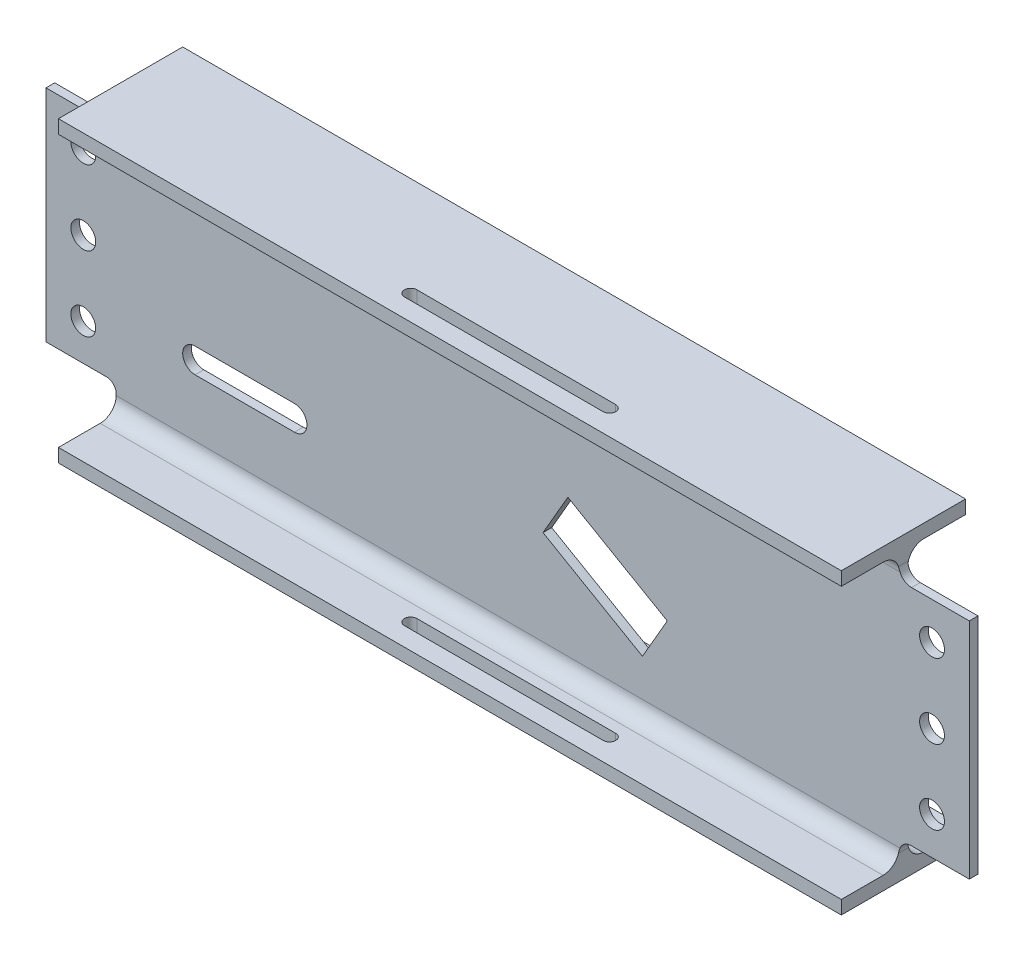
ISO-10303-21;
HEADER;
FILE_DESCRIPTION(('STEP AP214'),'2;1');
FILE_NAME('part.step','',(''),(''),'','','');
FILE_SCHEMA(('AUTOMOTIVE_DESIGN { 1 0 10303 214 1 1 1 1 }'));
ENDSEC;
DATA;
#1=APPLICATION_CONTEXT('core data for automotive mechanical design processes');
#2=APPLICATION_PROTOCOL_DEFINITION('international standard','automotive_design',2000,#1);
#3=PRODUCT_CONTEXT('',#1,'mechanical');
#4=PRODUCT('Part','Part','',(#3));
#5=PRODUCT_RELATED_PRODUCT_CATEGORY('part','',(#4));
#6=PRODUCT_DEFINITION_FORMATION('','',#4);
#7=PRODUCT_DEFINITION_CONTEXT('part definition',#1,'design');
#8=PRODUCT_DEFINITION('design','',#6,#7);
#9=PRODUCT_DEFINITION_SHAPE('','',#8);
#10=(LENGTH_UNIT() NAMED_UNIT(*) SI_UNIT(.MILLI.,.METRE.));
#11=(NAMED_UNIT(*) PLANE_ANGLE_UNIT() SI_UNIT($,.RADIAN.));
#12=(NAMED_UNIT(*) SI_UNIT($,.STERADIAN.) SOLID_ANGLE_UNIT());
#13=UNCERTAINTY_MEASURE_WITH_UNIT(LENGTH_MEASURE(1.E-05),#10,'distance_accuracy_value','');
#14=(GEOMETRIC_REPRESENTATION_CONTEXT(3) GLOBAL_UNCERTAINTY_ASSIGNED_CONTEXT((#13)) GLOBAL_UNIT_ASSIGNED_CONTEXT((#10,
#11,#12)) REPRESENTATION_CONTEXT('',''));
#15=CARTESIAN_POINT('',(0.,0.,0.));
#16=DIRECTION('',(0.,0.,1.));
#17=DIRECTION('',(1.,0.,0.));
#18=AXIS2_PLACEMENT_3D('',#15,#16,#17);
#19=CARTESIAN_POINT('',(1000.,-13.8176,-63.4999999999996));
#20=DIRECTION('',(0.,-1.,0.));
#21=DIRECTION('',(0.,0.,-1.));
#22=AXIS2_PLACEMENT_3D('',#19,#20,#21);
#23=PLANE('',#22);
#24=DIRECTION('',(-1.,0.,0.));
#25=VECTOR('',#24,1.);
#26=CARTESIAN_POINT('',(1000.,-13.8176,-20.8533999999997));
#27=LINE('',#26,#25);
#28=CARTESIAN_POINT('',(900.1,-13.8176,-20.8534000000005));
#29=VERTEX_POINT('',#28);
#30=CARTESIAN_POINT('',(99.9,-13.8176,-20.8534000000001));
#31=VERTEX_POINT('',#30);
#32=EDGE_CURVE('E594',#29,#31,#27,.T.);
#33=ORIENTED_EDGE('',*,*,#32,.T.);
#34=DIRECTION('',(0.,0.,-1.));
#35=VECTOR('',#34,1.);
#36=CARTESIAN_POINT('',(99.9,-13.8176,-63.5));
#37=LINE('',#36,#35);
#38=CARTESIAN_POINT('',(99.9,-13.8176,-63.5));
#39=VERTEX_POINT('',#38);
#40=EDGE_CURVE('E509',#31,#39,#37,.T.);
#41=ORIENTED_EDGE('',*,*,#40,.T.);
#42=DIRECTION('',(-1.,0.,0.));
#43=VECTOR('',#42,1.);
#44=CARTESIAN_POINT('',(1000.,-13.8176,-63.4999999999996));
#45=LINE('',#44,#43);
#46=CARTESIAN_POINT('',(900.1,-13.8176,-63.5000000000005));
#47=VERTEX_POINT('',#46);
#48=EDGE_CURVE('E649',#47,#39,#45,.T.);
#49=ORIENTED_EDGE('',*,*,#48,.F.);
#50=DIRECTION('',(0.,0.,-1.));
#51=VECTOR('',#50,1.);
#52=CARTESIAN_POINT('',(900.1,-13.8176,-63.5000000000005));
#53=LINE('',#52,#51);
#54=EDGE_CURVE('E597',#29,#47,#53,.T.);
#55=ORIENTED_EDGE('',*,*,#54,.F.);
#56=EDGE_LOOP('',(#33,#41,#49,#55));
#57=FACE_BOUND('',#56,.T.);
#58=ADVANCED_FACE('F91',(#57),#23,.T.);
#59=CARTESIAN_POINT('',(1000.,0.,-63.4999999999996));
#60=DIRECTION('',(0.,0.,-1.));
#61=DIRECTION('',(0.,1.,0.));
#62=AXIS2_PLACEMENT_3D('',#59,#60,#61);
#63=PLANE('',#62);
#64=ORIENTED_EDGE('',*,*,#48,.T.);
#65=DIRECTION('',(0.,1.,0.));
#66=VECTOR('',#65,1.);
#67=CARTESIAN_POINT('',(99.9,0.,-63.5));
#68=LINE('',#67,#66);
#69=CARTESIAN_POINT('',(99.9,0.,-63.5));
#70=VERTEX_POINT('',#69);
#71=EDGE_CURVE('E512',#39,#70,#68,.T.);
#72=ORIENTED_EDGE('',*,*,#71,.T.);
#73=DIRECTION('',(-1.,0.,0.));
#74=VECTOR('',#73,1.);
#75=CARTESIAN_POINT('',(1000.,0.,-63.4999999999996));
#76=LINE('',#75,#74);
#77=CARTESIAN_POINT('',(900.1,0.,-63.5000000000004));
#78=VERTEX_POINT('',#77);
#79=EDGE_CURVE('E646',#78,#70,#76,.T.);
#80=ORIENTED_EDGE('',*,*,#79,.F.);
#81=DIRECTION('',(0.,1.,0.));
#82=VECTOR('',#81,1.);
#83=CARTESIAN_POINT('',(900.1,0.,-63.5000000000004));
#84=LINE('',#83,#82);
#85=EDGE_CURVE('E898',#47,#78,#84,.T.);
#86=ORIENTED_EDGE('',*,*,#85,.F.);
#87=EDGE_LOOP('',(#64,#72,#80,#86));
#88=FACE_BOUND('',#87,.T.);
#89=ADVANCED_FACE('F584',(#88),#63,.T.);
#90=CARTESIAN_POINT('',(1000.,0.,63.5000000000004));
#91=DIRECTION('',(0.,1.,0.));
#92=DIRECTION('',(0.,0.,1.));
#93=AXIS2_PLACEMENT_3D('',#90,#91,#92);
#94=PLANE('',#93);
#95=CARTESIAN_POINT('',(434.55,0.,38.1));
#96=DIRECTION('',(0.,1.,0.));
#97=DIRECTION('',(0.,0.,1.));
#98=AXIS2_PLACEMENT_3D('',#95,#96,#97);
#99=CIRCLE('',#98,6.35);
#100=CARTESIAN_POINT('',(434.55,0.,31.75));
#101=VERTEX_POINT('',#100);
#102=CARTESIAN_POINT('',(434.55,0.,44.45));
#103=VERTEX_POINT('',#102);
#104=EDGE_CURVE('E394',#101,#103,#99,.T.);
#105=ORIENTED_EDGE('',*,*,#104,.F.);
#106=DIRECTION('',(-1.,0.,0.));
#107=VECTOR('',#106,1.);
#108=CARTESIAN_POINT('',(434.55,0.,31.75));
#109=LINE('',#108,#107);
#110=CARTESIAN_POINT('',(637.75,0.,31.75));
#111=VERTEX_POINT('',#110);
#112=EDGE_CURVE('E399',#111,#101,#109,.T.);
#113=ORIENTED_EDGE('',*,*,#112,.F.);
#114=CARTESIAN_POINT('',(637.75,0.,38.1));
#115=DIRECTION('',(0.,1.,0.));
#116=DIRECTION('',(0.,0.,1.));
#117=AXIS2_PLACEMENT_3D('',#114,#115,#116);
#118=CIRCLE('',#117,6.35);
#119=CARTESIAN_POINT('',(637.75,0.,44.45));
#120=VERTEX_POINT('',#119);
#121=EDGE_CURVE('E413',#120,#111,#118,.T.);
#122=ORIENTED_EDGE('',*,*,#121,.F.);
#123=DIRECTION('',(1.,0.,0.));
#124=VECTOR('',#123,1.);
#125=CARTESIAN_POINT('',(434.55,0.,44.45));
#126=LINE('',#125,#124);
#127=EDGE_CURVE('E410',#103,#120,#126,.T.);
#128=ORIENTED_EDGE('',*,*,#127,.F.);
#129=EDGE_LOOP('',(#105,#113,#122,#128));
#130=FACE_BOUND('',#129,.T.);
#131=ORIENTED_EDGE('',*,*,#79,.T.);
#132=DIRECTION('',(0.,0.,1.));
#133=VECTOR('',#132,1.);
#134=CARTESIAN_POINT('',(99.9,0.,63.5));
#135=LINE('',#134,#133);
#136=CARTESIAN_POINT('',(99.9,0.,63.5));
#137=VERTEX_POINT('',#136);
#138=EDGE_CURVE('E515',#70,#137,#135,.T.);
#139=ORIENTED_EDGE('',*,*,#138,.T.);
#140=DIRECTION('',(-1.,0.,0.));
#141=VECTOR('',#140,1.);
#142=CARTESIAN_POINT('',(1000.,0.,63.5000000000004));
#143=LINE('',#142,#141);
#144=CARTESIAN_POINT('',(900.1,0.,63.4999999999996));
#145=VERTEX_POINT('',#144);
#146=EDGE_CURVE('E643',#145,#137,#143,.T.);
#147=ORIENTED_EDGE('',*,*,#146,.F.);
#148=DIRECTION('',(0.,0.,-1.));
#149=VECTOR('',#148,1.);
#150=CARTESIAN_POINT('',(900.1,0.,-63.5000000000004));
#151=LINE('',#150,#149);
#152=EDGE_CURVE('E896',#145,#78,#151,.T.);
#153=ORIENTED_EDGE('',*,*,#152,.T.);
#154=EDGE_LOOP('',(#131,#139,#147,#153));
#155=FACE_BOUND('',#154,.T.);
#156=ADVANCED_FACE('F589',(#130,#155),#94,.T.);
#157=CARTESIAN_POINT('',(1000.,0.,63.5000000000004));
#158=DIRECTION('',(0.,0.,-1.));
#159=DIRECTION('',(0.,1.,0.));
#160=AXIS2_PLACEMENT_3D('',#157,#158,#159);
#161=PLANE('',#160);
#162=DIRECTION('',(0.,1.,0.));
#163=VECTOR('',#162,1.);
#164=CARTESIAN_POINT('',(99.9,0.,63.5));
#165=LINE('',#164,#163);
#166=CARTESIAN_POINT('',(99.9,-13.8176,63.5));
#167=VERTEX_POINT('',#166);
#168=EDGE_CURVE('E518',#167,#137,#165,.T.);
#169=ORIENTED_EDGE('',*,*,#168,.F.);
#170=DIRECTION('',(-1.,0.,0.));
#171=VECTOR('',#170,1.);
#172=CARTESIAN_POINT('',(1000.,-13.8176,63.5000000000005));
#173=LINE('',#172,#171);
#174=CARTESIAN_POINT('',(900.1,-13.8176,63.4999999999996));
#175=VERTEX_POINT('',#174);
#176=EDGE_CURVE('E640',#175,#167,#173,.T.);
#177=ORIENTED_EDGE('',*,*,#176,.F.);
#178=DIRECTION('',(0.,1.,0.));
#179=VECTOR('',#178,1.);
#180=CARTESIAN_POINT('',(900.1,0.,63.4999999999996));
#181=LINE('',#180,#179);
#182=EDGE_CURVE('E912',#175,#145,#181,.T.);
#183=ORIENTED_EDGE('',*,*,#182,.T.);
#184=ORIENTED_EDGE('',*,*,#146,.T.);
#185=EDGE_LOOP('',(#169,#177,#183,#184));
#186=FACE_BOUND('',#185,.T.);
#187=ADVANCED_FACE('F880',(#186),#161,.F.);
#188=CARTESIAN_POINT('',(1000.,-13.8176,63.5000000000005));
#189=DIRECTION('',(0.,1.,0.));
#190=DIRECTION('',(0.,0.,1.));
#191=AXIS2_PLACEMENT_3D('',#188,#189,#190);
#192=PLANE('',#191);
#193=DIRECTION('',(-1.,0.,0.));
#194=VECTOR('',#193,1.);
#195=CARTESIAN_POINT('',(1000.,-13.8176,31.75));
#196=LINE('',#195,#194);
#197=CARTESIAN_POINT('',(637.75,-13.8176000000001,31.75));
#198=VERTEX_POINT('',#197);
#199=CARTESIAN_POINT('',(434.55,-13.8176000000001,31.75));
#200=VERTEX_POINT('',#199);
#201=EDGE_CURVE('E444',#198,#200,#196,.T.);
#202=ORIENTED_EDGE('',*,*,#201,.T.);
#203=CARTESIAN_POINT('',(434.55,-13.8176,38.1));
#204=DIRECTION('',(0.,1.,0.));
#205=DIRECTION('',(0.,0.,1.));
#206=AXIS2_PLACEMENT_3D('',#203,#204,#205);
#207=CIRCLE('',#206,6.35);
#208=CARTESIAN_POINT('',(434.55,-13.8176000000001,44.45));
#209=VERTEX_POINT('',#208);
#210=EDGE_CURVE('E450',#200,#209,#207,.T.);
#211=ORIENTED_EDGE('',*,*,#210,.T.);
#212=DIRECTION('',(1.,0.,0.));
#213=VECTOR('',#212,1.);
#214=CARTESIAN_POINT('',(1000.,-13.8176,44.45));
#215=LINE('',#214,#213);
#216=CARTESIAN_POINT('',(637.75,-13.8176,44.45));
#217=VERTEX_POINT('',#216);
#218=EDGE_CURVE('E434',#209,#217,#215,.T.);
#219=ORIENTED_EDGE('',*,*,#218,.T.);
#220=CARTESIAN_POINT('',(637.75,-13.8176,38.1));
#221=DIRECTION('',(0.,1.,0.));
#222=DIRECTION('',(0.,0.,1.));
#223=AXIS2_PLACEMENT_3D('',#220,#221,#222);
#224=CIRCLE('',#223,6.35);
#225=EDGE_CURVE('E439',#217,#198,#224,.T.);
#226=ORIENTED_EDGE('',*,*,#225,.T.);
#227=EDGE_LOOP('',(#202,#211,#219,#226));
#228=FACE_BOUND('',#227,.T.);
#229=DIRECTION('',(0.,0.,1.));
#230=VECTOR('',#229,1.);
#231=CARTESIAN_POINT('',(99.9,-13.8176,63.5));
#232=LINE('',#231,#230);
#233=CARTESIAN_POINT('',(99.9,-13.8176,20.8534000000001));
#234=VERTEX_POINT('',#233);
#235=EDGE_CURVE('E520',#234,#167,#232,.T.);
#236=ORIENTED_EDGE('',*,*,#235,.F.);
#237=DIRECTION('',(-1.,0.,0.));
#238=VECTOR('',#237,1.);
#239=CARTESIAN_POINT('',(1000.,-13.8176,20.8534000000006));
#240=LINE('',#239,#238);
#241=CARTESIAN_POINT('',(900.1,-13.8176,20.8533999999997));
#242=VERTEX_POINT('',#241);
#243=EDGE_CURVE('E637',#242,#234,#240,.T.);
#244=ORIENTED_EDGE('',*,*,#243,.F.);
#245=DIRECTION('',(0.,0.,1.));
#246=VECTOR('',#245,1.);
#247=CARTESIAN_POINT('',(900.1,-13.8176,63.4999999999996));
#248=LINE('',#247,#246);
#249=EDGE_CURVE('E908',#242,#175,#248,.T.);
#250=ORIENTED_EDGE('',*,*,#249,.T.);
#251=ORIENTED_EDGE('',*,*,#176,.T.);
#252=EDGE_LOOP('',(#236,#244,#250,#251));
#253=FACE_BOUND('',#252,.T.);
#254=ADVANCED_FACE('F876',(#228,#253),#192,.F.);
#255=CARTESIAN_POINT('',(1000.,-30.226,20.8534000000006));
#256=DIRECTION('',(-1.,0.,0.));
#257=DIRECTION('',(0.,0.,1.));
#258=AXIS2_PLACEMENT_3D('',#255,#256,#257);
#259=CYLINDRICAL_SURFACE('',#258,16.4084);
#260=CARTESIAN_POINT('',(99.6713931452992,-30.226,4.44500000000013));
#261=CARTESIAN_POINT('',(99.7095398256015,-30.0507266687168,4.44498809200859));
#262=CARTESIAN_POINT('',(99.7429485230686,-29.8744198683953,4.44780840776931));
#263=CARTESIAN_POINT('',(99.8001110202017,-29.5211396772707,4.45920047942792));
#264=CARTESIAN_POINT('',(99.8239019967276,-29.3441715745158,4.46774974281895));
#265=CARTESIAN_POINT('',(99.8619488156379,-28.9895897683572,4.49068499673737));
#266=CARTESIAN_POINT('',(99.8762046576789,-28.8119760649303,4.50507098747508));
#267=CARTESIAN_POINT('',(99.8952546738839,-28.4561124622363,4.5397469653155));
#268=CARTESIAN_POINT('',(99.9000115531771,-28.2778627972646,4.5600598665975));
#269=CARTESIAN_POINT('',(99.9,-28.1,4.58331350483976));
#270=B_SPLINE_CURVE_WITH_KNOTS('',3,(#260,#261,#262,#263,#264,#265,#266,#267,#268,#269),
.UNSPECIFIED.,.F.,.F.,(4,2,2,2,4),(0.,0.538045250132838,1.07399035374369,1.60993547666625,
2.14798072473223),.UNSPECIFIED.);
#271=CARTESIAN_POINT('',(99.6713931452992,-30.226,4.44500000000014));
#272=VERTEX_POINT('',#271);
#273=CARTESIAN_POINT('',(99.9,-28.1,4.58331350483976));
#274=VERTEX_POINT('',#273);
#275=EDGE_CURVE('E529',#272,#274,#270,.T.);
#276=ORIENTED_EDGE('',*,*,#275,.F.);
#277=DIRECTION('',(-1.,0.,0.));
#278=VECTOR('',#277,1.);
#279=CARTESIAN_POINT('',(1000.,-30.226,4.44500000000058));
#280=LINE('',#279,#278);
#281=CARTESIAN_POINT('',(901.052671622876,-30.226,4.4449999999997));
#282=VERTEX_POINT('',#281);
#283=EDGE_CURVE('E634',#282,#272,#280,.T.);
#284=ORIENTED_EDGE('',*,*,#283,.F.);
#285=CARTESIAN_POINT('',(901.052671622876,-30.226,4.4449999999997));
#286=CARTESIAN_POINT('',(900.996977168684,-30.0904323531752,4.4449989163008));
#287=CARTESIAN_POINT('',(900.943637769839,-29.9539143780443,4.44668065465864));
#288=CARTESIAN_POINT('',(900.841737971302,-29.6791865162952,4.45353819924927));
#289=CARTESIAN_POINT('',(900.793177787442,-29.5409765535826,4.45871416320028));
#290=CARTESIAN_POINT('',(900.654757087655,-29.1240814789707,4.47967878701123));
#291=CARTESIAN_POINT('',(900.572180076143,-28.8431887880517,4.500904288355));
#292=CARTESIAN_POINT('',(900.428396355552,-28.2836108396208,4.55799475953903));
#293=CARTESIAN_POINT('',(900.366790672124,-28.0049961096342,4.59355450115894));
#294=CARTESIAN_POINT('',(900.262780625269,-27.4466369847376,4.67964111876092));
#295=CARTESIAN_POINT('',(900.220365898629,-27.1668932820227,4.73015989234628));
#296=CARTESIAN_POINT('',(900.15811909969,-26.6391252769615,4.8398342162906));
#297=CARTESIAN_POINT('',(900.13631311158,-26.3910036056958,4.89742390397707));
#298=CARTESIAN_POINT('',(900.107171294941,-25.8946361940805,5.02489979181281));
#299=CARTESIAN_POINT('',(900.099970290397,-25.6464102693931,5.09489413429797));
#300=CARTESIAN_POINT('',(900.1,-25.4,5.17075626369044));
#301=B_SPLINE_CURVE_WITH_KNOTS('',3,(#285,#286,#287,#288,#289,#290,#291,#292,#293,#294,#295,
#296,#297,#298,#299,#300),.UNSPECIFIED.,.F.,.F.,(4,2,2,2,2,2,2,4),(0.,0.439621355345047,
0.879262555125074,1.75873117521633,2.62038628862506,3.48157554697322,4.24783614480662,
5.02113875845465),.UNSPECIFIED.);
#302=CARTESIAN_POINT('',(900.1,-25.4,5.17075626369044));
#303=VERTEX_POINT('',#302);
#304=EDGE_CURVE('E804',#282,#303,#301,.T.);
#305=ORIENTED_EDGE('',*,*,#304,.T.);
#306=CARTESIAN_POINT('',(900.1,-30.226,20.8533999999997));
#307=DIRECTION('',(1.,0.,0.));
#308=DIRECTION('',(0.,-1.,0.));
#309=AXIS2_PLACEMENT_3D('',#306,#307,#308);
#310=CIRCLE('',#309,16.4084);
#311=EDGE_CURVE('E813',#303,#242,#310,.T.);
#312=ORIENTED_EDGE('',*,*,#311,.T.);
#313=ORIENTED_EDGE('',*,*,#243,.T.);
#314=CARTESIAN_POINT('',(99.9,-30.226,20.8534000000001));
#315=DIRECTION('',(-1.,0.,0.));
#316=DIRECTION('',(0.,-1.,0.));
#317=AXIS2_PLACEMENT_3D('',#314,#315,#316);
#318=CIRCLE('',#317,16.4084);
#319=EDGE_CURVE('E522',#274,#234,#318,.F.);
#320=ORIENTED_EDGE('',*,*,#319,.F.);
#321=EDGE_LOOP('',(#276,#284,#305,#312,#313,#320));
#322=FACE_BOUND('',#321,.T.);
#323=ADVANCED_FACE('F871',(#322),#259,.F.);
#324=CARTESIAN_POINT('',(1000.,-274.574,20.8534000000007));
#325=DIRECTION('',(-1.,0.,0.));
#326=DIRECTION('',(0.,0.,1.));
#327=AXIS2_PLACEMENT_3D('',#324,#325,#326);
#328=CYLINDRICAL_SURFACE('',#327,16.4084000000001);
#329=DIRECTION('',(-1.,0.,0.));
#330=VECTOR('',#329,1.);
#331=CARTESIAN_POINT('',(1000.,-274.574,4.44500000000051));
#332=LINE('',#331,#330);
#333=CARTESIAN_POINT('',(901.052671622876,-274.574,4.44499999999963));
#334=VERTEX_POINT('',#333);
#335=CARTESIAN_POINT('',(99.9,-274.574,4.44500000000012));
#336=VERTEX_POINT('',#335);
#337=EDGE_CURVE('E631',#334,#336,#332,.T.);
#338=ORIENTED_EDGE('',*,*,#337,.T.);
#339=CARTESIAN_POINT('',(99.9,-274.574,20.8534000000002));
#340=DIRECTION('',(-1.,0.,0.));
#341=DIRECTION('',(0.,-1.,0.));
#342=AXIS2_PLACEMENT_3D('',#339,#340,#341);
#343=CIRCLE('',#342,16.4084000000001);
#344=CARTESIAN_POINT('',(99.9,-290.9824,20.8534000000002));
#345=VERTEX_POINT('',#344);
#346=EDGE_CURVE('E749',#336,#345,#343,.T.);
#347=ORIENTED_EDGE('',*,*,#346,.T.);
#348=DIRECTION('',(-1.,0.,0.));
#349=VECTOR('',#348,1.);
#350=CARTESIAN_POINT('',(1000.,-290.9824,20.8534000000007));
#351=LINE('',#350,#349);
#352=CARTESIAN_POINT('',(900.1,-290.9824,20.8533999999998));
#353=VERTEX_POINT('',#352);
#354=EDGE_CURVE('E628',#353,#345,#351,.T.);
#355=ORIENTED_EDGE('',*,*,#354,.F.);
#356=CARTESIAN_POINT('',(900.1,-274.574,20.8533999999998));
#357=DIRECTION('',(1.,0.,0.));
#358=DIRECTION('',(0.,-1.,0.));
#359=AXIS2_PLACEMENT_3D('',#356,#357,#358);
#360=CIRCLE('',#359,16.4084000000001);
#361=CARTESIAN_POINT('',(900.1,-279.4,5.17075626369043));
#362=VERTEX_POINT('',#361);
#363=EDGE_CURVE('E602',#362,#353,#360,.F.);
#364=ORIENTED_EDGE('',*,*,#363,.F.);
#365=CARTESIAN_POINT('',(901.052671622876,-274.574,4.44499999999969));
#366=CARTESIAN_POINT('',(900.996977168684,-274.709567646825,4.44499891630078));
#367=CARTESIAN_POINT('',(900.943637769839,-274.846085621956,4.44668065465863));
#368=CARTESIAN_POINT('',(900.841737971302,-275.120813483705,4.45353819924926));
#369=CARTESIAN_POINT('',(900.793177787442,-275.259023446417,4.45871416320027));
#370=CARTESIAN_POINT('',(900.654757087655,-275.675918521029,4.47967878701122));
#371=CARTESIAN_POINT('',(900.572180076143,-275.956811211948,4.50090428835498));
#372=CARTESIAN_POINT('',(900.428396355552,-276.516389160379,4.55799475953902));
#373=CARTESIAN_POINT('',(900.366790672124,-276.795003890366,4.59355450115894));
#374=CARTESIAN_POINT('',(900.262780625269,-277.353363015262,4.67964111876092));
#375=CARTESIAN_POINT('',(900.220365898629,-277.633106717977,4.73015989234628));
#376=CARTESIAN_POINT('',(900.15811909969,-278.160874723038,4.8398342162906));
#377=CARTESIAN_POINT('',(900.13631311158,-278.408996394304,4.89742390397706));
#378=CARTESIAN_POINT('',(900.107171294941,-278.905363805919,5.02489979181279));
#379=CARTESIAN_POINT('',(900.099970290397,-279.153589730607,5.09489413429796));
#380=CARTESIAN_POINT('',(900.1,-279.4,5.17075626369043));
#381=B_SPLINE_CURVE_WITH_KNOTS('',3,(#365,#366,#367,#368,#369,#370,#371,#372,#373,#374,#375,
#376,#377,#378,#379,#380),.UNSPECIFIED.,.F.,.F.,(4,2,2,2,2,2,2,4),(0.,0.439621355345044,
0.879262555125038,1.75873117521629,2.62038628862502,3.48157554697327,4.24783614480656,
5.02113875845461),.UNSPECIFIED.);
#382=EDGE_CURVE('E771',#334,#362,#381,.T.);
#383=ORIENTED_EDGE('',*,*,#382,.F.);
#384=EDGE_LOOP('',(#338,#347,#355,#364,#383));
#385=FACE_BOUND('',#384,.T.);
#386=ADVANCED_FACE('F768',(#385),#328,.F.);
#387=CARTESIAN_POINT('',(1000.,-290.9824,63.5000000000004));
#388=DIRECTION('',(0.,1.,0.));
#389=DIRECTION('',(0.,0.,1.));
#390=AXIS2_PLACEMENT_3D('',#387,#388,#389);
#391=PLANE('',#390);
#392=CARTESIAN_POINT('',(434.55,-290.9824,38.1));
#393=DIRECTION('',(0.,1.,0.));
#394=DIRECTION('',(0.,0.,1.));
#395=AXIS2_PLACEMENT_3D('',#392,#393,#394);
#396=CIRCLE('',#395,6.35);
#397=CARTESIAN_POINT('',(434.55,-290.9824,31.75));
#398=VERTEX_POINT('',#397);
#399=CARTESIAN_POINT('',(434.55,-290.9824,44.45));
#400=VERTEX_POINT('',#399);
#401=EDGE_CURVE('E447',#398,#400,#396,.T.);
#402=ORIENTED_EDGE('',*,*,#401,.F.);
#403=DIRECTION('',(-1.,0.,0.));
#404=VECTOR('',#403,1.);
#405=CARTESIAN_POINT('',(1000.,-290.9824,31.75));
#406=LINE('',#405,#404);
#407=CARTESIAN_POINT('',(637.75,-290.9824,31.75));
#408=VERTEX_POINT('',#407);
#409=EDGE_CURVE('E442',#408,#398,#406,.T.);
#410=ORIENTED_EDGE('',*,*,#409,.F.);
#411=CARTESIAN_POINT('',(637.75,-290.9824,38.1));
#412=DIRECTION('',(0.,1.,0.));
#413=DIRECTION('',(0.,0.,1.));
#414=AXIS2_PLACEMENT_3D('',#411,#412,#413);
#415=CIRCLE('',#414,6.35);
#416=CARTESIAN_POINT('',(637.75,-290.9824,44.45));
#417=VERTEX_POINT('',#416);
#418=EDGE_CURVE('E437',#417,#408,#415,.T.);
#419=ORIENTED_EDGE('',*,*,#418,.F.);
#420=DIRECTION('',(1.,0.,0.));
#421=VECTOR('',#420,1.);
#422=CARTESIAN_POINT('',(1000.,-290.9824,44.45));
#423=LINE('',#422,#421);
#424=EDGE_CURVE('E421',#400,#417,#423,.T.);
#425=ORIENTED_EDGE('',*,*,#424,.F.);
#426=EDGE_LOOP('',(#402,#410,#419,#425));
#427=FACE_BOUND('',#426,.T.);
#428=ORIENTED_EDGE('',*,*,#354,.T.);
#429=DIRECTION('',(0.,0.,1.));
#430=VECTOR('',#429,1.);
#431=CARTESIAN_POINT('',(99.9,-290.9824,63.5));
#432=LINE('',#431,#430);
#433=CARTESIAN_POINT('',(99.9,-290.9824,63.5));
#434=VERTEX_POINT('',#433);
#435=EDGE_CURVE('E754',#345,#434,#432,.T.);
#436=ORIENTED_EDGE('',*,*,#435,.T.);
#437=DIRECTION('',(-1.,0.,0.));
#438=VECTOR('',#437,1.);
#439=CARTESIAN_POINT('',(1000.,-290.9824,63.5000000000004));
#440=LINE('',#439,#438);
#441=CARTESIAN_POINT('',(900.1,-290.9824,63.4999999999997));
#442=VERTEX_POINT('',#441);
#443=EDGE_CURVE('E625',#442,#434,#440,.T.);
#444=ORIENTED_EDGE('',*,*,#443,.F.);
#445=DIRECTION('',(0.,0.,1.));
#446=VECTOR('',#445,1.);
#447=CARTESIAN_POINT('',(900.1,-290.9824,63.4999999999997));
#448=LINE('',#447,#446);
#449=EDGE_CURVE('E980',#353,#442,#448,.T.);
#450=ORIENTED_EDGE('',*,*,#449,.F.);
#451=EDGE_LOOP('',(#428,#436,#444,#450));
#452=FACE_BOUND('',#451,.T.);
#453=ADVANCED_FACE('F864',(#427,#452),#391,.T.);
#454=CARTESIAN_POINT('',(1000.,-304.8,63.5000000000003));
#455=DIRECTION('',(0.,0.,1.));
#456=DIRECTION('',(0.,-1.,0.));
#457=AXIS2_PLACEMENT_3D('',#454,#455,#456);
#458=PLANE('',#457);
#459=ORIENTED_EDGE('',*,*,#443,.T.);
#460=DIRECTION('',(0.,-1.,0.));
#461=VECTOR('',#460,1.);
#462=CARTESIAN_POINT('',(99.9,-304.8,63.4999999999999));
#463=LINE('',#462,#461);
#464=CARTESIAN_POINT('',(99.9,-304.8,63.4999999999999));
#465=VERTEX_POINT('',#464);
#466=EDGE_CURVE('E951',#434,#465,#463,.T.);
#467=ORIENTED_EDGE('',*,*,#466,.T.);
#468=DIRECTION('',(-1.,0.,0.));
#469=VECTOR('',#468,1.);
#470=CARTESIAN_POINT('',(1000.,-304.8,63.5000000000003));
#471=LINE('',#470,#469);
#472=CARTESIAN_POINT('',(900.1,-304.8,63.4999999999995));
#473=VERTEX_POINT('',#472);
#474=EDGE_CURVE('E622',#473,#465,#471,.T.);
#475=ORIENTED_EDGE('',*,*,#474,.F.);
#476=DIRECTION('',(0.,-1.,0.));
#477=VECTOR('',#476,1.);
#478=CARTESIAN_POINT('',(900.1,-304.8,63.4999999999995));
#479=LINE('',#478,#477);
#480=EDGE_CURVE('E978',#442,#473,#479,.T.);
#481=ORIENTED_EDGE('',*,*,#480,.F.);
#482=EDGE_LOOP('',(#459,#467,#475,#481));
#483=FACE_BOUND('',#482,.T.);
#484=ADVANCED_FACE('F860',(#483),#458,.T.);
#485=CARTESIAN_POINT('',(1000.,-304.8,63.5000000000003));
#486=DIRECTION('',(0.,1.,0.));
#487=DIRECTION('',(0.,0.,1.));
#488=AXIS2_PLACEMENT_3D('',#485,#486,#487);
#489=PLANE('',#488);
#490=DIRECTION('',(-1.,0.,0.));
#491=VECTOR('',#490,1.);
#492=CARTESIAN_POINT('',(434.55,-304.8,31.75));
#493=LINE('',#492,#491);
#494=CARTESIAN_POINT('',(637.75,-304.8,31.75));
#495=VERTEX_POINT('',#494);
#496=CARTESIAN_POINT('',(434.55,-304.8,31.75));
#497=VERTEX_POINT('',#496);
#498=EDGE_CURVE('E405',#495,#497,#493,.T.);
#499=ORIENTED_EDGE('',*,*,#498,.T.);
#500=CARTESIAN_POINT('',(434.55,-304.8,38.1));
#501=DIRECTION('',(0.,1.,0.));
#502=DIRECTION('',(0.,0.,1.));
#503=AXIS2_PLACEMENT_3D('',#500,#501,#502);
#504=CIRCLE('',#503,6.35);
#505=CARTESIAN_POINT('',(434.55,-304.8,44.45));
#506=VERTEX_POINT('',#505);
#507=EDGE_CURVE('E395',#497,#506,#504,.T.);
#508=ORIENTED_EDGE('',*,*,#507,.T.);
#509=DIRECTION('',(1.,0.,0.));
#510=VECTOR('',#509,1.);
#511=CARTESIAN_POINT('',(434.55,-304.8,44.45));
#512=LINE('',#511,#510);
#513=CARTESIAN_POINT('',(637.75,-304.8,44.45));
#514=VERTEX_POINT('',#513);
#515=EDGE_CURVE('E398',#506,#514,#512,.T.);
#516=ORIENTED_EDGE('',*,*,#515,.T.);
#517=CARTESIAN_POINT('',(637.75,-304.8,38.1));
#518=DIRECTION('',(0.,1.,0.));
#519=DIRECTION('',(0.,0.,1.));
#520=AXIS2_PLACEMENT_3D('',#517,#518,#519);
#521=CIRCLE('',#520,6.35);
#522=EDGE_CURVE('E402',#514,#495,#521,.T.);
#523=ORIENTED_EDGE('',*,*,#522,.T.);
#524=EDGE_LOOP('',(#499,#508,#516,#523));
#525=FACE_BOUND('',#524,.T.);
#526=DIRECTION('',(0.,0.,1.));
#527=VECTOR('',#526,1.);
#528=CARTESIAN_POINT('',(99.9,-304.8,63.4999999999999));
#529=LINE('',#528,#527);
#530=CARTESIAN_POINT('',(99.9,-304.8,-63.4999999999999));
#531=VERTEX_POINT('',#530);
#532=EDGE_CURVE('E954',#531,#465,#529,.T.);
#533=ORIENTED_EDGE('',*,*,#532,.F.);
#534=DIRECTION('',(-1.,0.,0.));
#535=VECTOR('',#534,1.);
#536=CARTESIAN_POINT('',(1000.,-304.8,-63.4999999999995));
#537=LINE('',#536,#535);
#538=CARTESIAN_POINT('',(900.1,-304.8,-63.5000000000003));
#539=VERTEX_POINT('',#538);
#540=EDGE_CURVE('E619',#539,#531,#537,.T.);
#541=ORIENTED_EDGE('',*,*,#540,.F.);
#542=DIRECTION('',(0.,0.,-1.));
#543=VECTOR('',#542,1.);
#544=CARTESIAN_POINT('',(900.1,-304.8,-63.5000000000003));
#545=LINE('',#544,#543);
#546=EDGE_CURVE('E976',#473,#539,#545,.T.);
#547=ORIENTED_EDGE('',*,*,#546,.F.);
#548=ORIENTED_EDGE('',*,*,#474,.T.);
#549=EDGE_LOOP('',(#533,#541,#547,#548));
#550=FACE_BOUND('',#549,.T.);
#551=ADVANCED_FACE('F856',(#525,#550),#489,.F.);
#552=CARTESIAN_POINT('',(1000.,-304.8,-63.4999999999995));
#553=DIRECTION('',(0.,0.,1.));
#554=DIRECTION('',(0.,-1.,0.));
#555=AXIS2_PLACEMENT_3D('',#552,#553,#554);
#556=PLANE('',#555);
#557=DIRECTION('',(0.,-1.,0.));
#558=VECTOR('',#557,1.);
#559=CARTESIAN_POINT('',(99.9,-304.8,-63.4999999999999));
#560=LINE('',#559,#558);
#561=CARTESIAN_POINT('',(99.9,-290.9824,-63.5000000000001));
#562=VERTEX_POINT('',#561);
#563=EDGE_CURVE('E956',#562,#531,#560,.T.);
#564=ORIENTED_EDGE('',*,*,#563,.F.);
#565=DIRECTION('',(-1.,0.,0.));
#566=VECTOR('',#565,1.);
#567=CARTESIAN_POINT('',(1000.,-290.9824,-63.4999999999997));
#568=LINE('',#567,#566);
#569=CARTESIAN_POINT('',(900.1,-290.9824,-63.5000000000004));
#570=VERTEX_POINT('',#569);
#571=EDGE_CURVE('E616',#570,#562,#568,.T.);
#572=ORIENTED_EDGE('',*,*,#571,.F.);
#573=DIRECTION('',(0.,-1.,0.));
#574=VECTOR('',#573,1.);
#575=CARTESIAN_POINT('',(900.1,-304.8,-63.5000000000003));
#576=LINE('',#575,#574);
#577=EDGE_CURVE('E971',#570,#539,#576,.T.);
#578=ORIENTED_EDGE('',*,*,#577,.T.);
#579=ORIENTED_EDGE('',*,*,#540,.T.);
#580=EDGE_LOOP('',(#564,#572,#578,#579));
#581=FACE_BOUND('',#580,.T.);
#582=ADVANCED_FACE('F852',(#581),#556,.F.);
#583=CARTESIAN_POINT('',(1000.,-290.9824,-63.4999999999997));
#584=DIRECTION('',(0.,-1.,0.));
#585=DIRECTION('',(0.,0.,-1.));
#586=AXIS2_PLACEMENT_3D('',#583,#584,#585);
#587=PLANE('',#586);
#588=DIRECTION('',(0.,0.,-1.));
#589=VECTOR('',#588,1.);
#590=CARTESIAN_POINT('',(99.9,-290.9824,-63.5000000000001));
#591=LINE('',#590,#589);
#592=CARTESIAN_POINT('',(99.9,-290.9824,-20.8534000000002));
#593=VERTEX_POINT('',#592);
#594=EDGE_CURVE('E957',#593,#562,#591,.T.);
#595=ORIENTED_EDGE('',*,*,#594,.F.);
#596=DIRECTION('',(-1.,0.,0.));
#597=VECTOR('',#596,1.);
#598=CARTESIAN_POINT('',(1000.,-290.9824,-20.8533999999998));
#599=LINE('',#598,#597);
#600=CARTESIAN_POINT('',(900.1,-290.9824,-20.8534000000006));
#601=VERTEX_POINT('',#600);
#602=EDGE_CURVE('E613',#601,#593,#599,.T.);
#603=ORIENTED_EDGE('',*,*,#602,.F.);
#604=DIRECTION('',(0.,0.,-1.));
#605=VECTOR('',#604,1.);
#606=CARTESIAN_POINT('',(900.1,-290.9824,-63.5000000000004));
#607=LINE('',#606,#605);
#608=EDGE_CURVE('E970',#601,#570,#607,.T.);
#609=ORIENTED_EDGE('',*,*,#608,.T.);
#610=ORIENTED_EDGE('',*,*,#571,.T.);
#611=EDGE_LOOP('',(#595,#603,#609,#610));
#612=FACE_BOUND('',#611,.T.);
#613=ADVANCED_FACE('F848',(#612),#587,.F.);
#614=CARTESIAN_POINT('',(1000.,-274.574,-20.8533999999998));
#615=DIRECTION('',(-1.,0.,0.));
#616=DIRECTION('',(0.,0.,1.));
#617=AXIS2_PLACEMENT_3D('',#614,#615,#616);
#618=CYLINDRICAL_SURFACE('',#617,16.4084000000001);
#619=CARTESIAN_POINT('',(99.9,-274.574,-20.8534000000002));
#620=DIRECTION('',(-1.,0.,0.));
#621=DIRECTION('',(0.,-1.,0.));
#622=AXIS2_PLACEMENT_3D('',#619,#620,#621);
#623=CIRCLE('',#622,16.4084000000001);
#624=CARTESIAN_POINT('',(99.9,-274.574,-4.44500000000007));
#625=VERTEX_POINT('',#624);
#626=EDGE_CURVE('E537',#625,#593,#623,.F.);
#627=ORIENTED_EDGE('',*,*,#626,.F.);
#628=DIRECTION('',(-1.,0.,0.));
#629=VECTOR('',#628,1.);
#630=CARTESIAN_POINT('',(1000.,-274.574,-4.44499999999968));
#631=LINE('',#630,#629);
#632=CARTESIAN_POINT('',(901.052671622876,-274.574,-4.44500000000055));
#633=VERTEX_POINT('',#632);
#634=EDGE_CURVE('E605',#633,#625,#631,.T.);
#635=ORIENTED_EDGE('',*,*,#634,.F.);
#636=CARTESIAN_POINT('',(901.052671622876,-274.574,-4.44500000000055));
#637=CARTESIAN_POINT('',(900.996977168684,-274.709567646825,-4.44499891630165));
#638=CARTESIAN_POINT('',(900.943637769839,-274.846085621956,-4.4466806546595));
#639=CARTESIAN_POINT('',(900.841737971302,-275.120813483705,-4.45353819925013));
#640=CARTESIAN_POINT('',(900.793177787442,-275.259023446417,-4.45871416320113));
#641=CARTESIAN_POINT('',(900.654757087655,-275.675918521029,-4.47967878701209));
#642=CARTESIAN_POINT('',(900.572180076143,-275.956811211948,-4.50090428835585));
#643=CARTESIAN_POINT('',(900.428396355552,-276.516389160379,-4.55799475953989));
#644=CARTESIAN_POINT('',(900.366790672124,-276.795003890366,-4.59355450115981));
#645=CARTESIAN_POINT('',(900.262780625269,-277.353363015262,-4.67964111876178));
#646=CARTESIAN_POINT('',(900.220365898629,-277.633106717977,-4.73015989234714));
#647=CARTESIAN_POINT('',(900.158119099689,-278.160874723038,-4.83983421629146));
#648=CARTESIAN_POINT('',(900.13631311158,-278.408996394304,-4.89742390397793));
#649=CARTESIAN_POINT('',(900.107171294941,-278.905363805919,-5.02489979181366));
#650=CARTESIAN_POINT('',(900.099970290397,-279.153589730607,-5.09489413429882));
#651=CARTESIAN_POINT('',(900.1,-279.4,-5.17075626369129));
#652=B_SPLINE_CURVE_WITH_KNOTS('',3,(#636,#637,#638,#639,#640,#641,#642,#643,#644,#645,#646,
#647,#648,#649,#650,#651),.UNSPECIFIED.,.F.,.F.,(4,2,2,2,2,2,2,4),(0.,0.439621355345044,
0.879262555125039,1.75873117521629,2.62038628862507,3.48157554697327,4.24783614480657,
5.02113875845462),.UNSPECIFIED.);
#653=CARTESIAN_POINT('',(900.1,-279.4,-5.17075626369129));
#654=VERTEX_POINT('',#653);
#655=EDGE_CURVE('E773',#633,#654,#652,.T.);
#656=ORIENTED_EDGE('',*,*,#655,.T.);
#657=CARTESIAN_POINT('',(900.1,-274.574,-20.8534000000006));
#658=DIRECTION('',(1.,0.,0.));
#659=DIRECTION('',(0.,-1.,0.));
#660=AXIS2_PLACEMENT_3D('',#657,#658,#659);
#661=CIRCLE('',#660,16.4084000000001);
#662=EDGE_CURVE('E968',#654,#601,#661,.T.);
#663=ORIENTED_EDGE('',*,*,#662,.T.);
#664=ORIENTED_EDGE('',*,*,#602,.T.);
#665=EDGE_LOOP('',(#627,#635,#656,#663,#664));
#666=FACE_BOUND('',#665,.T.);
#667=ADVANCED_FACE('F843',(#666),#618,.F.);
#668=CARTESIAN_POINT('',(1000.,-30.226,-20.8533999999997));
#669=DIRECTION('',(-1.,0.,0.));
#670=DIRECTION('',(0.,0.,1.));
#671=AXIS2_PLACEMENT_3D('',#668,#669,#670);
#672=CYLINDRICAL_SURFACE('',#671,16.4084);
#673=DIRECTION('',(-1.,0.,0.));
#674=VECTOR('',#673,1.);
#675=CARTESIAN_POINT('',(1000.,-30.226,-4.4449999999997));
#676=LINE('',#675,#674);
#677=CARTESIAN_POINT('',(901.052671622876,-30.226,-4.44500000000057));
#678=VERTEX_POINT('',#677);
#679=CARTESIAN_POINT('',(99.6713931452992,-30.226,-4.44500000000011));
#680=VERTEX_POINT('',#679);
#681=EDGE_CURVE('E601',#678,#680,#676,.T.);
#682=ORIENTED_EDGE('',*,*,#681,.T.);
#683=CARTESIAN_POINT('',(99.6713931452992,-30.226,-4.44500000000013));
#684=CARTESIAN_POINT('',(99.7095398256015,-30.0507266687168,-4.4449880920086));
#685=CARTESIAN_POINT('',(99.7429485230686,-29.8744198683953,-4.44780840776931));
#686=CARTESIAN_POINT('',(99.8001110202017,-29.5211396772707,-4.45920047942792));
#687=CARTESIAN_POINT('',(99.8239019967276,-29.3441715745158,-4.46774974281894));
#688=CARTESIAN_POINT('',(99.8619488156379,-28.9895897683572,-4.49068499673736));
#689=CARTESIAN_POINT('',(99.8762046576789,-28.8119760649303,-4.50507098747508));
#690=CARTESIAN_POINT('',(99.8952546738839,-28.4561124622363,-4.5397469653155));
#691=CARTESIAN_POINT('',(99.9000115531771,-28.2778627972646,-4.5600598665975));
#692=CARTESIAN_POINT('',(99.9,-28.1,-4.58331350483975));
#693=B_SPLINE_CURVE_WITH_KNOTS('',3,(#683,#684,#685,#686,#687,#688,#689,#690,#691,#692),
.UNSPECIFIED.,.F.,.F.,(4,2,2,2,4),(0.,0.538045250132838,1.07399035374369,1.60993547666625,
2.14798072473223),.UNSPECIFIED.);
#694=CARTESIAN_POINT('',(99.9,-28.1,-4.58331350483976));
#695=VERTEX_POINT('',#694);
#696=EDGE_CURVE('E555',#680,#695,#693,.T.);
#697=ORIENTED_EDGE('',*,*,#696,.T.);
#698=CARTESIAN_POINT('',(99.9,-30.226,-20.8534000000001));
#699=DIRECTION('',(-1.,0.,0.));
#700=DIRECTION('',(0.,-1.,0.));
#701=AXIS2_PLACEMENT_3D('',#698,#699,#700);
#702=CIRCLE('',#701,16.4084);
#703=EDGE_CURVE('E563',#695,#31,#702,.T.);
#704=ORIENTED_EDGE('',*,*,#703,.T.);
#705=ORIENTED_EDGE('',*,*,#32,.F.);
#706=CARTESIAN_POINT('',(900.1,-30.226,-20.8534000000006));
#707=DIRECTION('',(1.,0.,0.));
#708=DIRECTION('',(0.,-1.,0.));
#709=AXIS2_PLACEMENT_3D('',#706,#707,#708);
#710=CIRCLE('',#709,16.4084);
#711=CARTESIAN_POINT('',(900.1,-25.4,-5.17075626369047));
#712=VERTEX_POINT('',#711);
#713=EDGE_CURVE('E923',#712,#29,#710,.F.);
#714=ORIENTED_EDGE('',*,*,#713,.F.);
#715=CARTESIAN_POINT('',(901.052671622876,-30.226,-4.44500000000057));
#716=CARTESIAN_POINT('',(900.996977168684,-30.0904323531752,-4.44499891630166));
#717=CARTESIAN_POINT('',(900.943637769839,-29.9539143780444,-4.44668065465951));
#718=CARTESIAN_POINT('',(900.841737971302,-29.6791865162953,-4.45353819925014));
#719=CARTESIAN_POINT('',(900.793177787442,-29.5409765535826,-4.45871416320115));
#720=CARTESIAN_POINT('',(900.654757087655,-29.1240814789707,-4.4796787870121));
#721=CARTESIAN_POINT('',(900.572180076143,-28.8431887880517,-4.50090428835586));
#722=CARTESIAN_POINT('',(900.428396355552,-28.2836108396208,-4.5579947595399));
#723=CARTESIAN_POINT('',(900.366790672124,-28.0049961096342,-4.59355450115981));
#724=CARTESIAN_POINT('',(900.262780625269,-27.4466369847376,-4.67964111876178));
#725=CARTESIAN_POINT('',(900.220365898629,-27.1668932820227,-4.73015989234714));
#726=CARTESIAN_POINT('',(900.15811909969,-26.6391252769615,-4.83983421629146));
#727=CARTESIAN_POINT('',(900.13631311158,-26.3910036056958,-4.89742390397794));
#728=CARTESIAN_POINT('',(900.107171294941,-25.8946361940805,-5.02489979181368));
#729=CARTESIAN_POINT('',(900.099970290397,-25.6464102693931,-5.09489413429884));
#730=CARTESIAN_POINT('',(900.1,-25.4,-5.17075626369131));
#731=B_SPLINE_CURVE_WITH_KNOTS('',3,(#715,#716,#717,#718,#719,#720,#721,#722,#723,#724,#725,
#726,#727,#728,#729,#730),.UNSPECIFIED.,.F.,.F.,(4,2,2,2,2,2,2,4),(0.,0.439621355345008,
0.879262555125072,1.75873117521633,2.62038628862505,3.48157554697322,4.24783614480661,
5.02113875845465),.UNSPECIFIED.);
#732=EDGE_CURVE('E827',#678,#712,#731,.T.);
#733=ORIENTED_EDGE('',*,*,#732,.F.);
#734=EDGE_LOOP('',(#682,#697,#704,#705,#714,#733));
#735=FACE_BOUND('',#734,.T.);
#736=ADVANCED_FACE('F840',(#735),#672,.F.);
#737=CARTESIAN_POINT('',(1000.,-30.226,4.44500000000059));
#738=DIRECTION('',(0.,0.,-1.));
#739=DIRECTION('',(-1.,0.,0.));
#740=AXIS2_PLACEMENT_3D('',#737,#738,#739);
#741=PLANE('',#740);
#742=DIRECTION('',(-1.,0.,0.));
#743=VECTOR('',#742,1.);
#744=CARTESIAN_POINT('',(1000.,-215.9,4.44500000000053));
#745=LINE('',#744,#743);
#746=CARTESIAN_POINT('',(282.15,-215.9,4.44500000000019));
#747=VERTEX_POINT('',#746);
#748=CARTESIAN_POINT('',(180.55,-215.9,4.44500000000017));
#749=VERTEX_POINT('',#748);
#750=EDGE_CURVE('E367',#747,#749,#745,.T.);
#751=ORIENTED_EDGE('',*,*,#750,.T.);
#752=CARTESIAN_POINT('',(180.55,-203.2,4.44500000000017));
#753=DIRECTION('',(0.,0.,-1.));
#754=DIRECTION('',(-1.,0.,0.));
#755=AXIS2_PLACEMENT_3D('',#752,#753,#754);
#756=CIRCLE('',#755,12.7);
#757=CARTESIAN_POINT('',(180.55,-190.5,4.4450000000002));
#758=VERTEX_POINT('',#757);
#759=EDGE_CURVE('E389',#749,#758,#756,.T.);
#760=ORIENTED_EDGE('',*,*,#759,.T.);
#761=DIRECTION('',(1.,0.,0.));
#762=VECTOR('',#761,1.);
#763=CARTESIAN_POINT('',(1000.,-190.5,4.44500000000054));
#764=LINE('',#763,#762);
#765=CARTESIAN_POINT('',(282.15,-190.5,4.44500000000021));
#766=VERTEX_POINT('',#765);
#767=EDGE_CURVE('E387',#758,#766,#764,.T.);
#768=ORIENTED_EDGE('',*,*,#767,.T.);
#769=CARTESIAN_POINT('',(282.15,-203.2,4.44500000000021));
#770=DIRECTION('',(0.,0.,-1.));
#771=DIRECTION('',(-1.,0.,0.));
#772=AXIS2_PLACEMENT_3D('',#769,#770,#771);
#773=CIRCLE('',#772,12.7);
#774=EDGE_CURVE('E372',#766,#747,#773,.T.);
#775=ORIENTED_EDGE('',*,*,#774,.T.);
#776=EDGE_LOOP('',(#751,#760,#768,#775));
#777=FACE_BOUND('',#776,.T.);
#778=DIRECTION('',(0.866025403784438,-0.500000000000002,0.));
#779=VECTOR('',#778,1.);
#780=CARTESIAN_POINT('',(845.536083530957,-297.765351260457,4.44500000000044));
#781=LINE('',#780,#779);
#782=CARTESIAN_POINT('',(561.55,-133.805909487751,4.44500000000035));
#783=VERTEX_POINT('',#782);
#784=CARTESIAN_POINT('',(663.15,-192.464696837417,4.44500000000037));
#785=VERTEX_POINT('',#784);
#786=EDGE_CURVE('E479',#783,#785,#781,.T.);
#787=ORIENTED_EDGE('',*,*,#786,.T.);
#788=DIRECTION('',(-0.499999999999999,-0.866025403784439,0.));
#789=VECTOR('',#788,1.);
#790=CARTESIAN_POINT('',(817.613916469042,75.07465442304,4.44500000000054));
#791=LINE('',#790,#789);
#792=CARTESIAN_POINT('',(637.75,-236.458787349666,4.44500000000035));
#793=VERTEX_POINT('',#792);
#794=EDGE_CURVE('E482',#785,#793,#791,.T.);
#795=ORIENTED_EDGE('',*,*,#794,.T.);
#796=DIRECTION('',(-0.866025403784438,0.500000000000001,0.));
#797=VECTOR('',#796,1.);
#798=CARTESIAN_POINT('',(820.136083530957,-341.759441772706,4.44500000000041));
#799=LINE('',#798,#797);
#800=CARTESIAN_POINT('',(536.15,-177.8,4.44500000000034));
#801=VERTEX_POINT('',#800);
#802=EDGE_CURVE('E467',#793,#801,#799,.T.);
#803=ORIENTED_EDGE('',*,*,#802,.T.);
#804=DIRECTION('',(0.500000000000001,0.866025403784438,0.));
#805=VECTOR('',#804,1.);
#806=CARTESIAN_POINT('',(716.013916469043,133.733441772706,4.44500000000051));
#807=LINE('',#806,#805);
#808=EDGE_CURVE('E476',#801,#783,#807,.T.);
#809=ORIENTED_EDGE('',*,*,#808,.T.);
#810=EDGE_LOOP('',(#787,#795,#803,#809));
#811=FACE_BOUND('',#810,.T.);
#812=CARTESIAN_POINT('',(66.2500000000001,-149.3,4.44500000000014));
#813=DIRECTION('',(0.,0.,-1.));
#814=DIRECTION('',(-1.,0.,0.));
#815=AXIS2_PLACEMENT_3D('',#812,#813,#814);
#816=CIRCLE('',#815,12.7);
#817=CARTESIAN_POINT('',(53.5500000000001,-149.3,4.44500000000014));
#818=VERTEX_POINT('',#817);
#819=EDGE_CURVE('E490',#818,#818,#816,.F.);
#820=ORIENTED_EDGE('',*,*,#819,.F.);
#821=EDGE_LOOP('',(#820));
#822=FACE_BOUND('',#821,.T.);
#823=CARTESIAN_POINT('',(66.2500000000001,-73.1,4.44500000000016));
#824=DIRECTION('',(0.,0.,-1.));
#825=DIRECTION('',(-1.,0.,0.));
#826=AXIS2_PLACEMENT_3D('',#823,#824,#825);
#827=CIRCLE('',#826,12.7);
#828=CARTESIAN_POINT('',(53.5500000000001,-73.1,4.44500000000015));
#829=VERTEX_POINT('',#828);
#830=EDGE_CURVE('E486',#829,#829,#827,.F.);
#831=ORIENTED_EDGE('',*,*,#830,.F.);
#832=EDGE_LOOP('',(#831));
#833=FACE_BOUND('',#832,.T.);
#834=CARTESIAN_POINT('',(66.2500000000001,-225.5,4.44500000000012));
#835=DIRECTION('',(0.,0.,-1.));
#836=DIRECTION('',(-1.,0.,0.));
#837=AXIS2_PLACEMENT_3D('',#834,#835,#836);
#838=CIRCLE('',#837,12.7);
#839=CARTESIAN_POINT('',(53.5500000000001,-225.5,4.44500000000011));
#840=VERTEX_POINT('',#839);
#841=EDGE_CURVE('E494',#840,#840,#838,.F.);
#842=ORIENTED_EDGE('',*,*,#841,.F.);
#843=EDGE_LOOP('',(#842));
#844=FACE_BOUND('',#843,.T.);
#845=DIRECTION('',(0.,1.,0.));
#846=VECTOR('',#845,1.);
#847=CARTESIAN_POINT('',(99.9,-30.226,4.44500000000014));
#848=LINE('',#847,#846);
#849=CARTESIAN_POINT('',(99.9,-273.,4.44500000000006));
#850=VERTEX_POINT('',#849);
#851=EDGE_CURVE('E751',#336,#850,#848,.T.);
#852=ORIENTED_EDGE('',*,*,#851,.F.);
#853=ORIENTED_EDGE('',*,*,#337,.F.);
#854=CARTESIAN_POINT('',(912.8,-279.4,4.44499999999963));
#855=DIRECTION('',(0.,0.,1.));
#856=DIRECTION('',(0.,1.,0.));
#857=AXIS2_PLACEMENT_3D('',#854,#855,#856);
#858=CIRCLE('',#857,12.7);
#859=CARTESIAN_POINT('',(912.8,-266.7,4.44499999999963));
#860=VERTEX_POINT('',#859);
#861=EDGE_CURVE('E607',#334,#860,#858,.F.);
#862=ORIENTED_EDGE('',*,*,#861,.T.);
#863=DIRECTION('',(1.,0.,0.));
#864=VECTOR('',#863,1.);
#865=CARTESIAN_POINT('',(800.,-266.7,4.44499999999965));
#866=LINE('',#865,#864);
#867=CARTESIAN_POINT('',(971.85,-266.7,4.44499999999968));
#868=VERTEX_POINT('',#867);
#869=EDGE_CURVE('E990',#860,#868,#866,.T.);
#870=ORIENTED_EDGE('',*,*,#869,.T.);
#871=DIRECTION('',(0.,1.,0.));
#872=VECTOR('',#871,1.);
#873=CARTESIAN_POINT('',(971.85,-30.226,4.4449999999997));
#874=LINE('',#873,#872);
#875=CARTESIAN_POINT('',(971.85,-38.1,4.4449999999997));
#876=VERTEX_POINT('',#875);
#877=EDGE_CURVE('E992',#868,#876,#874,.T.);
#878=ORIENTED_EDGE('',*,*,#877,.T.);
#879=DIRECTION('',(-1.,0.,0.));
#880=VECTOR('',#879,1.);
#881=CARTESIAN_POINT('',(800.,-38.1,4.44499999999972));
#882=LINE('',#881,#880);
#883=CARTESIAN_POINT('',(912.8,-38.1,4.44499999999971));
#884=VERTEX_POINT('',#883);
#885=EDGE_CURVE('E812',#876,#884,#882,.T.);
#886=ORIENTED_EDGE('',*,*,#885,.T.);
#887=CARTESIAN_POINT('',(912.8,-25.4,4.44499999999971));
#888=DIRECTION('',(0.,0.,1.));
#889=DIRECTION('',(0.,1.,0.));
#890=AXIS2_PLACEMENT_3D('',#887,#888,#889);
#891=CIRCLE('',#890,12.7);
#892=EDGE_CURVE('E924',#884,#282,#891,.F.);
#893=ORIENTED_EDGE('',*,*,#892,.T.);
#894=ORIENTED_EDGE('',*,*,#283,.T.);
#895=CARTESIAN_POINT('',(89.9,-28.1,4.44500000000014));
#896=DIRECTION('',(0.,0.,-1.));
#897=DIRECTION('',(0.,1.,0.));
#898=AXIS2_PLACEMENT_3D('',#895,#896,#897);
#899=CIRCLE('',#898,9.99999999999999);
#900=CARTESIAN_POINT('',(89.9,-38.1,4.44500000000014));
#901=VERTEX_POINT('',#900);
#902=EDGE_CURVE('E527',#901,#272,#899,.F.);
#903=ORIENTED_EDGE('',*,*,#902,.F.);
#904=DIRECTION('',(1.,0.,0.));
#905=VECTOR('',#904,1.);
#906=CARTESIAN_POINT('',(200.,-38.1,4.44500000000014));
#907=LINE('',#906,#905);
#908=CARTESIAN_POINT('',(28.1500000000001,-38.1,4.44500000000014));
#909=VERTEX_POINT('',#908);
#910=EDGE_CURVE('E765',#909,#901,#907,.T.);
#911=ORIENTED_EDGE('',*,*,#910,.F.);
#912=DIRECTION('',(0.,1.,0.));
#913=VECTOR('',#912,1.);
#914=CARTESIAN_POINT('',(28.1500000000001,-30.226,4.44500000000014));
#915=LINE('',#914,#913);
#916=CARTESIAN_POINT('',(28.1500000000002,-263.,4.44500000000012));
#917=VERTEX_POINT('',#916);
#918=EDGE_CURVE('E944',#917,#909,#915,.T.);
#919=ORIENTED_EDGE('',*,*,#918,.F.);
#920=DIRECTION('',(-1.,0.,0.));
#921=VECTOR('',#920,1.);
#922=CARTESIAN_POINT('',(200.,-263.,4.44500000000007));
#923=LINE('',#922,#921);
#924=CARTESIAN_POINT('',(89.9,-263.,4.44500000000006));
#925=VERTEX_POINT('',#924);
#926=EDGE_CURVE('E942',#925,#917,#923,.T.);
#927=ORIENTED_EDGE('',*,*,#926,.F.);
#928=CARTESIAN_POINT('',(89.9,-273.,4.44500000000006));
#929=DIRECTION('',(0.,0.,-1.));
#930=DIRECTION('',(0.,1.,0.));
#931=AXIS2_PLACEMENT_3D('',#928,#929,#930);
#932=CIRCLE('',#931,10.);
#933=EDGE_CURVE('E764',#850,#925,#932,.F.);
#934=ORIENTED_EDGE('',*,*,#933,.F.);
#935=EDGE_LOOP('',(#852,#853,#862,#870,#878,#886,#893,#894,#903,#911,#919,#927,#934));
#936=FACE_BOUND('',#935,.T.);
#937=CARTESIAN_POINT('',(933.75,-228.4,4.4450000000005));
#938=DIRECTION('',(0.,0.,-1.));
#939=DIRECTION('',(-1.,0.,0.));
#940=AXIS2_PLACEMENT_3D('',#937,#938,#939);
#941=CIRCLE('',#940,12.7);
#942=CARTESIAN_POINT('',(921.05,-228.4,4.4450000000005));
#943=VERTEX_POINT('',#942);
#944=EDGE_CURVE('E656',#943,#943,#941,.F.);
#945=ORIENTED_EDGE('',*,*,#944,.F.);
#946=EDGE_LOOP('',(#945));
#947=FACE_BOUND('',#946,.T.);
#948=CARTESIAN_POINT('',(933.75,-152.4,4.44500000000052));
#949=DIRECTION('',(0.,0.,-1.));
#950=DIRECTION('',(-1.,0.,0.));
#951=AXIS2_PLACEMENT_3D('',#948,#949,#950);
#952=CIRCLE('',#951,12.7);
#953=CARTESIAN_POINT('',(921.05,-152.4,4.44500000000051));
#954=VERTEX_POINT('',#953);
#955=EDGE_CURVE('E660',#954,#954,#952,.F.);
#956=ORIENTED_EDGE('',*,*,#955,.F.);
#957=EDGE_LOOP('',(#956));
#958=FACE_BOUND('',#957,.T.);
#959=CARTESIAN_POINT('',(933.75,-76.2,4.44500000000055));
#960=DIRECTION('',(0.,0.,-1.));
#961=DIRECTION('',(-1.,0.,0.));
#962=AXIS2_PLACEMENT_3D('',#959,#960,#961);
#963=CIRCLE('',#962,12.7);
#964=CARTESIAN_POINT('',(921.05,-76.2,4.44500000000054));
#965=VERTEX_POINT('',#964);
#966=EDGE_CURVE('E655',#965,#965,#963,.F.);
#967=ORIENTED_EDGE('',*,*,#966,.F.);
#968=EDGE_LOOP('',(#967));
#969=FACE_BOUND('',#968,.T.);
#970=ADVANCED_FACE('F385',(#777,#811,#822,#833,#844,#936,#947,#958,#969),#741,.F.);
#971=CARTESIAN_POINT('',(1000.,-30.226,-4.4449999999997));
#972=DIRECTION('',(0.,0.,-1.));
#973=DIRECTION('',(-1.,0.,0.));
#974=AXIS2_PLACEMENT_3D('',#971,#972,#973);
#975=PLANE('',#974);
#976=CARTESIAN_POINT('',(180.55,-203.2,-4.44500000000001));
#977=DIRECTION('',(0.,0.,-1.));
#978=DIRECTION('',(-1.,0.,0.));
#979=AXIS2_PLACEMENT_3D('',#976,#977,#978);
#980=CIRCLE('',#979,12.7);
#981=CARTESIAN_POINT('',(180.55,-215.9,-4.44499999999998));
#982=VERTEX_POINT('',#981);
#983=CARTESIAN_POINT('',(180.55,-190.5,-4.44499999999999));
#984=VERTEX_POINT('',#983);
#985=EDGE_CURVE('E12',#982,#984,#980,.T.);
#986=ORIENTED_EDGE('',*,*,#985,.F.);
#987=DIRECTION('',(-1.,0.,0.));
#988=VECTOR('',#987,1.);
#989=CARTESIAN_POINT('',(1000.,-215.9,-4.44499999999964));
#990=LINE('',#989,#988);
#991=CARTESIAN_POINT('',(282.15,-215.9,-4.44499999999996));
#992=VERTEX_POINT('',#991);
#993=EDGE_CURVE('E651',#992,#982,#990,.T.);
#994=ORIENTED_EDGE('',*,*,#993,.F.);
#995=CARTESIAN_POINT('',(282.15,-203.2,-4.44499999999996));
#996=DIRECTION('',(0.,0.,-1.));
#997=DIRECTION('',(-1.,0.,0.));
#998=AXIS2_PLACEMENT_3D('',#995,#996,#997);
#999=CIRCLE('',#998,12.7);
#1000=CARTESIAN_POINT('',(282.15,-190.5,-4.44499999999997));
#1001=VERTEX_POINT('',#1000);
#1002=EDGE_CURVE('E380',#1001,#992,#999,.T.);
#1003=ORIENTED_EDGE('',*,*,#1002,.F.);
#1004=DIRECTION('',(1.,0.,0.));
#1005=VECTOR('',#1004,1.);
#1006=CARTESIAN_POINT('',(1000.,-190.5,-4.44499999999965));
#1007=LINE('',#1006,#1005);
#1008=EDGE_CURVE('E98',#984,#1001,#1007,.T.);
#1009=ORIENTED_EDGE('',*,*,#1008,.F.);
#1010=EDGE_LOOP('',(#986,#994,#1003,#1009));
#1011=FACE_BOUND('',#1010,.T.);
#1012=DIRECTION('',(-0.499999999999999,-0.866025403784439,0.));
#1013=VECTOR('',#1012,1.);
#1014=CARTESIAN_POINT('',(663.15,-192.464696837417,-4.4449999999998));
#1015=LINE('',#1014,#1013);
#1016=CARTESIAN_POINT('',(663.15,-192.464696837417,-4.4449999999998));
#1017=VERTEX_POINT('',#1016);
#1018=CARTESIAN_POINT('',(637.75,-236.458787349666,-4.4449999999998));
#1019=VERTEX_POINT('',#1018);
#1020=EDGE_CURVE('E453',#1017,#1019,#1015,.T.);
#1021=ORIENTED_EDGE('',*,*,#1020,.F.);
#1022=DIRECTION('',(0.866025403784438,-0.500000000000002,0.));
#1023=VECTOR('',#1022,1.);
#1024=CARTESIAN_POINT('',(663.15,-192.464696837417,-4.4449999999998));
#1025=LINE('',#1024,#1023);
#1026=CARTESIAN_POINT('',(561.55,-133.805909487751,-4.44499999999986));
#1027=VERTEX_POINT('',#1026);
#1028=EDGE_CURVE('E461',#1027,#1017,#1025,.T.);
#1029=ORIENTED_EDGE('',*,*,#1028,.F.);
#1030=DIRECTION('',(0.500000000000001,0.866025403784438,0.));
#1031=VECTOR('',#1030,1.);
#1032=CARTESIAN_POINT('',(561.55,-133.805909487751,-4.44499999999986));
#1033=LINE('',#1032,#1031);
#1034=CARTESIAN_POINT('',(536.15,-177.8,-4.44499999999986));
#1035=VERTEX_POINT('',#1034);
#1036=EDGE_CURVE('E458',#1035,#1027,#1033,.T.);
#1037=ORIENTED_EDGE('',*,*,#1036,.F.);
#1038=DIRECTION('',(-0.866025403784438,0.500000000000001,0.));
#1039=VECTOR('',#1038,1.);
#1040=CARTESIAN_POINT('',(637.75,-236.458787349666,-4.4449999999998));
#1041=LINE('',#1040,#1039);
#1042=EDGE_CURVE('E455',#1019,#1035,#1041,.T.);
#1043=ORIENTED_EDGE('',*,*,#1042,.F.);
#1044=EDGE_LOOP('',(#1021,#1029,#1037,#1043));
#1045=FACE_BOUND('',#1044,.T.);
#1046=CARTESIAN_POINT('',(66.2500000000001,-149.3,-4.44500000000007));
#1047=DIRECTION('',(0.,0.,-1.));
#1048=DIRECTION('',(-1.,0.,0.));
#1049=AXIS2_PLACEMENT_3D('',#1046,#1047,#1048);
#1050=CIRCLE('',#1049,12.7);
#1051=CARTESIAN_POINT('',(53.5500000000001,-149.3,-4.44500000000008));
#1052=VERTEX_POINT('',#1051);
#1053=EDGE_CURVE('E489',#1052,#1052,#1050,.F.);
#1054=ORIENTED_EDGE('',*,*,#1053,.T.);
#1055=EDGE_LOOP('',(#1054));
#1056=FACE_BOUND('',#1055,.T.);
#1057=CARTESIAN_POINT('',(66.2500000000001,-73.1,-4.4450000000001));
#1058=DIRECTION('',(0.,0.,-1.));
#1059=DIRECTION('',(-1.,0.,0.));
#1060=AXIS2_PLACEMENT_3D('',#1057,#1058,#1059);
#1061=CIRCLE('',#1060,12.7);
#1062=CARTESIAN_POINT('',(53.5500000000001,-73.1,-4.44500000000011));
#1063=VERTEX_POINT('',#1062);
#1064=EDGE_CURVE('E485',#1063,#1063,#1061,.F.);
#1065=ORIENTED_EDGE('',*,*,#1064,.T.);
#1066=EDGE_LOOP('',(#1065));
#1067=FACE_BOUND('',#1066,.T.);
#1068=CARTESIAN_POINT('',(66.2500000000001,-225.5,-4.44500000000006));
#1069=DIRECTION('',(0.,0.,-1.));
#1070=DIRECTION('',(-1.,0.,0.));
#1071=AXIS2_PLACEMENT_3D('',#1068,#1069,#1070);
#1072=CIRCLE('',#1071,12.7);
#1073=CARTESIAN_POINT('',(53.5500000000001,-225.5,-4.44500000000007));
#1074=VERTEX_POINT('',#1073);
#1075=EDGE_CURVE('E493',#1074,#1074,#1072,.F.);
#1076=ORIENTED_EDGE('',*,*,#1075,.T.);
#1077=EDGE_LOOP('',(#1076));
#1078=FACE_BOUND('',#1077,.T.);
#1079=CARTESIAN_POINT('',(933.75,-228.4,-4.44499999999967));
#1080=DIRECTION('',(0.,0.,-1.));
#1081=DIRECTION('',(-1.,0.,0.));
#1082=AXIS2_PLACEMENT_3D('',#1079,#1080,#1081);
#1083=CIRCLE('',#1082,12.7);
#1084=CARTESIAN_POINT('',(921.05,-228.4,-4.44499999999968));
#1085=VERTEX_POINT('',#1084);
#1086=EDGE_CURVE('E662',#1085,#1085,#1083,.F.);
#1087=ORIENTED_EDGE('',*,*,#1086,.T.);
#1088=EDGE_LOOP('',(#1087));
#1089=FACE_BOUND('',#1088,.T.);
#1090=CARTESIAN_POINT('',(933.75,-152.4,-4.44499999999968));
#1091=DIRECTION('',(0.,0.,-1.));
#1092=DIRECTION('',(-1.,0.,0.));
#1093=AXIS2_PLACEMENT_3D('',#1090,#1091,#1092);
#1094=CIRCLE('',#1093,12.7);
#1095=CARTESIAN_POINT('',(921.05,-152.4,-4.44499999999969));
#1096=VERTEX_POINT('',#1095);
#1097=EDGE_CURVE('E657',#1096,#1096,#1094,.F.);
#1098=ORIENTED_EDGE('',*,*,#1097,.T.);
#1099=EDGE_LOOP('',(#1098));
#1100=FACE_BOUND('',#1099,.T.);
#1101=CARTESIAN_POINT('',(933.75,-76.2,-4.44499999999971));
#1102=DIRECTION('',(0.,0.,-1.));
#1103=DIRECTION('',(-1.,0.,0.));
#1104=AXIS2_PLACEMENT_3D('',#1101,#1102,#1103);
#1105=CIRCLE('',#1104,12.7);
#1106=CARTESIAN_POINT('',(921.05,-76.2,-4.44499999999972));
#1107=VERTEX_POINT('',#1106);
#1108=EDGE_CURVE('E652',#1107,#1107,#1105,.F.);
#1109=ORIENTED_EDGE('',*,*,#1108,.T.);
#1110=EDGE_LOOP('',(#1109));
#1111=FACE_BOUND('',#1110,.T.);
#1112=ORIENTED_EDGE('',*,*,#634,.T.);
#1113=DIRECTION('',(0.,1.,0.));
#1114=VECTOR('',#1113,1.);
#1115=CARTESIAN_POINT('',(99.9,-30.226,-4.44500000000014));
#1116=LINE('',#1115,#1114);
#1117=CARTESIAN_POINT('',(99.9,-273.,-4.44500000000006));
#1118=VERTEX_POINT('',#1117);
#1119=EDGE_CURVE('E562',#625,#1118,#1116,.T.);
#1120=ORIENTED_EDGE('',*,*,#1119,.T.);
#1121=CARTESIAN_POINT('',(89.9,-273.,-4.44500000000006));
#1122=DIRECTION('',(0.,0.,-1.));
#1123=DIRECTION('',(0.,1.,0.));
#1124=AXIS2_PLACEMENT_3D('',#1121,#1122,#1123);
#1125=CIRCLE('',#1124,10.);
#1126=CARTESIAN_POINT('',(89.9,-263.,-4.44500000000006));
#1127=VERTEX_POINT('',#1126);
#1128=EDGE_CURVE('E1011',#1118,#1127,#1125,.F.);
#1129=ORIENTED_EDGE('',*,*,#1128,.T.);
#1130=DIRECTION('',(-1.,0.,0.));
#1131=VECTOR('',#1130,1.);
#1132=CARTESIAN_POINT('',(200.,-263.,-4.44500000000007));
#1133=LINE('',#1132,#1131);
#1134=CARTESIAN_POINT('',(28.1500000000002,-263.,-4.44500000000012));
#1135=VERTEX_POINT('',#1134);
#1136=EDGE_CURVE('E1008',#1127,#1135,#1133,.T.);
#1137=ORIENTED_EDGE('',*,*,#1136,.T.);
#1138=DIRECTION('',(0.,1.,0.));
#1139=VECTOR('',#1138,1.);
#1140=CARTESIAN_POINT('',(28.1500000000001,-30.226,-4.44500000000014));
#1141=LINE('',#1140,#1139);
#1142=CARTESIAN_POINT('',(28.1500000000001,-38.1,-4.44500000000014));
#1143=VERTEX_POINT('',#1142);
#1144=EDGE_CURVE('E1005',#1135,#1143,#1141,.T.);
#1145=ORIENTED_EDGE('',*,*,#1144,.T.);
#1146=DIRECTION('',(1.,0.,0.));
#1147=VECTOR('',#1146,1.);
#1148=CARTESIAN_POINT('',(200.,-38.1,-4.44500000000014));
#1149=LINE('',#1148,#1147);
#1150=CARTESIAN_POINT('',(89.9,-38.1,-4.44500000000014));
#1151=VERTEX_POINT('',#1150);
#1152=EDGE_CURVE('E661',#1143,#1151,#1149,.T.);
#1153=ORIENTED_EDGE('',*,*,#1152,.T.);
#1154=CARTESIAN_POINT('',(89.9,-28.1,-4.44500000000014));
#1155=DIRECTION('',(0.,0.,-1.));
#1156=DIRECTION('',(0.,1.,0.));
#1157=AXIS2_PLACEMENT_3D('',#1154,#1155,#1156);
#1158=CIRCLE('',#1157,9.99999999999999);
#1159=EDGE_CURVE('E524',#1151,#680,#1158,.F.);
#1160=ORIENTED_EDGE('',*,*,#1159,.T.);
#1161=ORIENTED_EDGE('',*,*,#681,.F.);
#1162=CARTESIAN_POINT('',(912.8,-25.4,-4.44500000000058));
#1163=DIRECTION('',(0.,0.,1.));
#1164=DIRECTION('',(0.,1.,0.));
#1165=AXIS2_PLACEMENT_3D('',#1162,#1163,#1164);
#1166=CIRCLE('',#1165,12.7);
#1167=CARTESIAN_POINT('',(912.8,-38.1,-4.44500000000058));
#1168=VERTEX_POINT('',#1167);
#1169=EDGE_CURVE('E835',#1168,#678,#1166,.F.);
#1170=ORIENTED_EDGE('',*,*,#1169,.F.);
#1171=DIRECTION('',(-1.,0.,0.));
#1172=VECTOR('',#1171,1.);
#1173=CARTESIAN_POINT('',(800.,-38.1,-4.44500000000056));
#1174=LINE('',#1173,#1172);
#1175=CARTESIAN_POINT('',(971.85,-38.1,-4.44500000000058));
#1176=VERTEX_POINT('',#1175);
#1177=EDGE_CURVE('E834',#1176,#1168,#1174,.T.);
#1178=ORIENTED_EDGE('',*,*,#1177,.F.);
#1179=DIRECTION('',(0.,1.,0.));
#1180=VECTOR('',#1179,1.);
#1181=CARTESIAN_POINT('',(971.85,-30.226,-4.44500000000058));
#1182=LINE('',#1181,#1180);
#1183=CARTESIAN_POINT('',(971.85,-266.7,-4.44500000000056));
#1184=VERTEX_POINT('',#1183);
#1185=EDGE_CURVE('E780',#1184,#1176,#1182,.T.);
#1186=ORIENTED_EDGE('',*,*,#1185,.F.);
#1187=DIRECTION('',(1.,0.,0.));
#1188=VECTOR('',#1187,1.);
#1189=CARTESIAN_POINT('',(800.,-266.7,-4.44500000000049));
#1190=LINE('',#1189,#1188);
#1191=CARTESIAN_POINT('',(912.8,-266.7,-4.44500000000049));
#1192=VERTEX_POINT('',#1191);
#1193=EDGE_CURVE('E774',#1192,#1184,#1190,.T.);
#1194=ORIENTED_EDGE('',*,*,#1193,.F.);
#1195=CARTESIAN_POINT('',(912.8,-279.4,-4.44500000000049));
#1196=DIRECTION('',(0.,0.,1.));
#1197=DIRECTION('',(0.,1.,0.));
#1198=AXIS2_PLACEMENT_3D('',#1195,#1196,#1197);
#1199=CIRCLE('',#1198,12.7);
#1200=EDGE_CURVE('E777',#633,#1192,#1199,.F.);
#1201=ORIENTED_EDGE('',*,*,#1200,.F.);
#1202=EDGE_LOOP('',(#1112,#1120,#1129,#1137,#1145,#1153,#1160,#1161,#1170,#1178,#1186,#1194,#1201));
#1203=FACE_BOUND('',#1202,.T.);
#1204=ADVANCED_FACE('F680',(#1011,#1045,#1056,#1067,#1078,#1089,#1100,#1111,#1203),#975,.T.);
#1205=CARTESIAN_POINT('',(912.8,-279.4,-150.));
#1206=DIRECTION('',(0.,0.,1.));
#1207=DIRECTION('',(1.,0.,0.));
#1208=AXIS2_PLACEMENT_3D('',#1205,#1206,#1207);
#1209=CYLINDRICAL_SURFACE('',#1208,12.7);
#1210=ORIENTED_EDGE('',*,*,#655,.F.);
#1211=ORIENTED_EDGE('',*,*,#1200,.T.);
#1212=DIRECTION('',(0.,0.,1.));
#1213=VECTOR('',#1212,1.);
#1214=CARTESIAN_POINT('',(912.8,-266.7,-150.));
#1215=LINE('',#1214,#1213);
#1216=EDGE_CURVE('E913',#1192,#860,#1215,.T.);
#1217=ORIENTED_EDGE('',*,*,#1216,.T.);
#1218=ORIENTED_EDGE('',*,*,#861,.F.);
#1219=ORIENTED_EDGE('',*,*,#382,.T.);
#1220=DIRECTION('',(0.,0.,1.));
#1221=VECTOR('',#1220,1.);
#1222=CARTESIAN_POINT('',(900.1,-279.4,-150.));
#1223=LINE('',#1222,#1221);
#1224=EDGE_CURVE('E1022',#654,#362,#1223,.T.);
#1225=ORIENTED_EDGE('',*,*,#1224,.F.);
#1226=EDGE_LOOP('',(#1210,#1211,#1217,#1218,#1219,#1225));
#1227=FACE_BOUND('',#1226,.T.);
#1228=ADVANCED_FACE('F795',(#1227),#1209,.F.);
#1229=CARTESIAN_POINT('',(971.85,-266.7,-150.));
#1230=DIRECTION('',(0.,-1.,0.));
#1231=DIRECTION('',(-1.,0.,0.));
#1232=AXIS2_PLACEMENT_3D('',#1229,#1230,#1231);
#1233=PLANE('',#1232);
#1234=ORIENTED_EDGE('',*,*,#1216,.F.);
#1235=ORIENTED_EDGE('',*,*,#1193,.T.);
#1236=DIRECTION('',(0.,0.,1.));
#1237=VECTOR('',#1236,1.);
#1238=CARTESIAN_POINT('',(971.85,-266.7,-150.));
#1239=LINE('',#1238,#1237);
#1240=EDGE_CURVE('E916',#1184,#868,#1239,.T.);
#1241=ORIENTED_EDGE('',*,*,#1240,.T.);
#1242=ORIENTED_EDGE('',*,*,#869,.F.);
#1243=EDGE_LOOP('',(#1234,#1235,#1241,#1242));
#1244=FACE_BOUND('',#1243,.T.);
#1245=ADVANCED_FACE('F799',(#1244),#1233,.T.);
#1246=CARTESIAN_POINT('',(971.85,-38.1,-150.));
#1247=DIRECTION('',(1.,0.,0.));
#1248=DIRECTION('',(0.,-1.,0.));
#1249=AXIS2_PLACEMENT_3D('',#1246,#1247,#1248);
#1250=PLANE('',#1249);
#1251=ORIENTED_EDGE('',*,*,#1240,.F.);
#1252=ORIENTED_EDGE('',*,*,#1185,.T.);
#1253=DIRECTION('',(0.,0.,1.));
#1254=VECTOR('',#1253,1.);
#1255=CARTESIAN_POINT('',(971.85,-38.1,-150.));
#1256=LINE('',#1255,#1254);
#1257=EDGE_CURVE('E996',#1176,#876,#1256,.T.);
#1258=ORIENTED_EDGE('',*,*,#1257,.T.);
#1259=ORIENTED_EDGE('',*,*,#877,.F.);
#1260=EDGE_LOOP('',(#1251,#1252,#1258,#1259));
#1261=FACE_BOUND('',#1260,.T.);
#1262=ADVANCED_FACE('F1026',(#1261),#1250,.T.);
#1263=CARTESIAN_POINT('',(912.8,-38.1,-150.));
#1264=DIRECTION('',(0.,1.,0.));
#1265=DIRECTION('',(1.,0.,0.));
#1266=AXIS2_PLACEMENT_3D('',#1263,#1264,#1265);
#1267=PLANE('',#1266);
#1268=ORIENTED_EDGE('',*,*,#1257,.F.);
#1269=ORIENTED_EDGE('',*,*,#1177,.T.);
#1270=DIRECTION('',(0.,0.,1.));
#1271=VECTOR('',#1270,1.);
#1272=CARTESIAN_POINT('',(912.8,-38.1,-150.));
#1273=LINE('',#1272,#1271);
#1274=EDGE_CURVE('E932',#1168,#884,#1273,.T.);
#1275=ORIENTED_EDGE('',*,*,#1274,.T.);
#1276=ORIENTED_EDGE('',*,*,#885,.F.);
#1277=EDGE_LOOP('',(#1268,#1269,#1275,#1276));
#1278=FACE_BOUND('',#1277,.T.);
#1279=ADVANCED_FACE('F822',(#1278),#1267,.T.);
#1280=CARTESIAN_POINT('',(912.8,-25.4,-150.));
#1281=DIRECTION('',(0.,0.,1.));
#1282=DIRECTION('',(1.,0.,0.));
#1283=AXIS2_PLACEMENT_3D('',#1280,#1281,#1282);
#1284=CYLINDRICAL_SURFACE('',#1283,12.7);
#1285=ORIENTED_EDGE('',*,*,#1169,.T.);
#1286=ORIENTED_EDGE('',*,*,#732,.T.);
#1287=DIRECTION('',(0.,0.,1.));
#1288=VECTOR('',#1287,1.);
#1289=CARTESIAN_POINT('',(900.1,-25.4,-150.));
#1290=LINE('',#1289,#1288);
#1291=EDGE_CURVE('E997',#712,#303,#1290,.T.);
#1292=ORIENTED_EDGE('',*,*,#1291,.T.);
#1293=ORIENTED_EDGE('',*,*,#304,.F.);
#1294=ORIENTED_EDGE('',*,*,#892,.F.);
#1295=ORIENTED_EDGE('',*,*,#1274,.F.);
#1296=EDGE_LOOP('',(#1285,#1286,#1292,#1293,#1294,#1295));
#1297=FACE_BOUND('',#1296,.T.);
#1298=ADVANCED_FACE('F816',(#1297),#1284,.F.);
#1299=CARTESIAN_POINT('',(900.1,200.,-150.));
#1300=DIRECTION('',(1.,0.,0.));
#1301=DIRECTION('',(0.,-1.,0.));
#1302=AXIS2_PLACEMENT_3D('',#1299,#1300,#1301);
#1303=PLANE('',#1302);
#1304=ORIENTED_EDGE('',*,*,#1291,.F.);
#1305=ORIENTED_EDGE('',*,*,#713,.T.);
#1306=ORIENTED_EDGE('',*,*,#54,.T.);
#1307=ORIENTED_EDGE('',*,*,#85,.T.);
#1308=ORIENTED_EDGE('',*,*,#152,.F.);
#1309=ORIENTED_EDGE('',*,*,#182,.F.);
#1310=ORIENTED_EDGE('',*,*,#249,.F.);
#1311=ORIENTED_EDGE('',*,*,#311,.F.);
#1312=EDGE_LOOP('',(#1304,#1305,#1306,#1307,#1308,#1309,#1310,#1311));
#1313=FACE_BOUND('',#1312,.T.);
#1314=ADVANCED_FACE('F821',(#1313),#1303,.T.);
#1315=CARTESIAN_POINT('',(900.1,-279.4,-150.));
#1316=DIRECTION('',(1.,0.,0.));
#1317=DIRECTION('',(0.,-1.,0.));
#1318=AXIS2_PLACEMENT_3D('',#1315,#1316,#1317);
#1319=PLANE('',#1318);
#1320=ORIENTED_EDGE('',*,*,#662,.F.);
#1321=ORIENTED_EDGE('',*,*,#1224,.T.);
#1322=ORIENTED_EDGE('',*,*,#363,.T.);
#1323=ORIENTED_EDGE('',*,*,#449,.T.);
#1324=ORIENTED_EDGE('',*,*,#480,.T.);
#1325=ORIENTED_EDGE('',*,*,#546,.T.);
#1326=ORIENTED_EDGE('',*,*,#577,.F.);
#1327=ORIENTED_EDGE('',*,*,#608,.F.);
#1328=EDGE_LOOP('',(#1320,#1321,#1322,#1323,#1324,#1325,#1326,#1327));
#1329=FACE_BOUND('',#1328,.T.);
#1330=ADVANCED_FACE('F1136',(#1329),#1319,.T.);
#1331=CARTESIAN_POINT('',(933.75,-76.2,83.5549999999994));
#1332=DIRECTION('',(0.,0.,-1.));
#1333=DIRECTION('',(-1.,0.,0.));
#1334=AXIS2_PLACEMENT_3D('',#1331,#1332,#1333);
#1335=CYLINDRICAL_SURFACE('',#1334,12.7);
#1336=ORIENTED_EDGE('',*,*,#1108,.F.);
#1337=EDGE_LOOP('',(#1336));
#1338=FACE_BOUND('',#1337,.T.);
#1339=ORIENTED_EDGE('',*,*,#966,.T.);
#1340=EDGE_LOOP('',(#1339));
#1341=FACE_BOUND('',#1340,.T.);
#1342=ADVANCED_FACE('F1126',(#1338,#1341),#1335,.F.);
#1343=CARTESIAN_POINT('',(933.75,-152.4,83.5549999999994));
#1344=DIRECTION('',(0.,0.,-1.));
#1345=DIRECTION('',(-1.,0.,0.));
#1346=AXIS2_PLACEMENT_3D('',#1343,#1344,#1345);
#1347=CYLINDRICAL_SURFACE('',#1346,12.7);
#1348=ORIENTED_EDGE('',*,*,#1097,.F.);
#1349=EDGE_LOOP('',(#1348));
#1350=FACE_BOUND('',#1349,.T.);
#1351=ORIENTED_EDGE('',*,*,#955,.T.);
#1352=EDGE_LOOP('',(#1351));
#1353=FACE_BOUND('',#1352,.T.);
#1354=ADVANCED_FACE('F1117',(#1350,#1353),#1347,.F.);
#1355=CARTESIAN_POINT('',(933.75,-228.4,83.5549999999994));
#1356=DIRECTION('',(0.,0.,-1.));
#1357=DIRECTION('',(-1.,0.,0.));
#1358=AXIS2_PLACEMENT_3D('',#1355,#1356,#1357);
#1359=CYLINDRICAL_SURFACE('',#1358,12.7);
#1360=ORIENTED_EDGE('',*,*,#1086,.F.);
#1361=EDGE_LOOP('',(#1360));
#1362=FACE_BOUND('',#1361,.T.);
#1363=ORIENTED_EDGE('',*,*,#944,.T.);
#1364=EDGE_LOOP('',(#1363));
#1365=FACE_BOUND('',#1364,.T.);
#1366=ADVANCED_FACE('F572',(#1362,#1365),#1359,.F.);
#1367=CARTESIAN_POINT('',(89.9,-273.,150.));
#1368=DIRECTION('',(0.,0.,-1.));
#1369=DIRECTION('',(-1.,0.,0.));
#1370=AXIS2_PLACEMENT_3D('',#1367,#1368,#1369);
#1371=CYLINDRICAL_SURFACE('',#1370,10.);
#1372=DIRECTION('',(0.,0.,-1.));
#1373=VECTOR('',#1372,1.);
#1374=CARTESIAN_POINT('',(99.9,-273.,150.));
#1375=LINE('',#1374,#1373);
#1376=EDGE_CURVE('E497',#850,#1118,#1375,.T.);
#1377=ORIENTED_EDGE('',*,*,#1376,.F.);
#1378=ORIENTED_EDGE('',*,*,#933,.T.);
#1379=DIRECTION('',(0.,0.,-1.));
#1380=VECTOR('',#1379,1.);
#1381=CARTESIAN_POINT('',(89.9,-263.,150.));
#1382=LINE('',#1381,#1380);
#1383=EDGE_CURVE('E507',#925,#1127,#1382,.T.);
#1384=ORIENTED_EDGE('',*,*,#1383,.T.);
#1385=ORIENTED_EDGE('',*,*,#1128,.F.);
#1386=EDGE_LOOP('',(#1377,#1378,#1384,#1385));
#1387=FACE_BOUND('',#1386,.T.);
#1388=ADVANCED_FACE('F568',(#1387),#1371,.F.);
#1389=CARTESIAN_POINT('',(28.1500000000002,-263.,150.));
#1390=DIRECTION('',(0.,-1.,0.));
#1391=DIRECTION('',(0.,0.,-1.));
#1392=AXIS2_PLACEMENT_3D('',#1389,#1390,#1391);
#1393=PLANE('',#1392);
#1394=ORIENTED_EDGE('',*,*,#1383,.F.);
#1395=ORIENTED_EDGE('',*,*,#926,.T.);
#1396=DIRECTION('',(0.,0.,-1.));
#1397=VECTOR('',#1396,1.);
#1398=CARTESIAN_POINT('',(28.1500000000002,-263.,150.));
#1399=LINE('',#1398,#1397);
#1400=EDGE_CURVE('E505',#917,#1135,#1399,.T.);
#1401=ORIENTED_EDGE('',*,*,#1400,.T.);
#1402=ORIENTED_EDGE('',*,*,#1136,.F.);
#1403=EDGE_LOOP('',(#1394,#1395,#1401,#1402));
#1404=FACE_BOUND('',#1403,.T.);
#1405=ADVANCED_FACE('F571',(#1404),#1393,.T.);
#1406=CARTESIAN_POINT('',(28.1500000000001,-38.1,150.));
#1407=DIRECTION('',(-1.,0.,0.));
#1408=DIRECTION('',(0.,-1.,0.));
#1409=AXIS2_PLACEMENT_3D('',#1406,#1407,#1408);
#1410=PLANE('',#1409);
#1411=ORIENTED_EDGE('',*,*,#1400,.F.);
#1412=ORIENTED_EDGE('',*,*,#918,.T.);
#1413=DIRECTION('',(0.,0.,-1.));
#1414=VECTOR('',#1413,1.);
#1415=CARTESIAN_POINT('',(28.1500000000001,-38.1,150.));
#1416=LINE('',#1415,#1414);
#1417=EDGE_CURVE('E503',#909,#1143,#1416,.T.);
#1418=ORIENTED_EDGE('',*,*,#1417,.T.);
#1419=ORIENTED_EDGE('',*,*,#1144,.F.);
#1420=EDGE_LOOP('',(#1411,#1412,#1418,#1419));
#1421=FACE_BOUND('',#1420,.T.);
#1422=ADVANCED_FACE('F575',(#1421),#1410,.T.);
#1423=CARTESIAN_POINT('',(89.9,-38.1,150.));
#1424=DIRECTION('',(0.,1.,0.));
#1425=DIRECTION('',(-1.,0.,0.));
#1426=AXIS2_PLACEMENT_3D('',#1423,#1424,#1425);
#1427=PLANE('',#1426);
#1428=ORIENTED_EDGE('',*,*,#1417,.F.);
#1429=ORIENTED_EDGE('',*,*,#910,.T.);
#1430=DIRECTION('',(0.,0.,-1.));
#1431=VECTOR('',#1430,1.);
#1432=CARTESIAN_POINT('',(89.9,-38.1,150.));
#1433=LINE('',#1432,#1431);
#1434=EDGE_CURVE('E501',#901,#1151,#1433,.T.);
#1435=ORIENTED_EDGE('',*,*,#1434,.T.);
#1436=ORIENTED_EDGE('',*,*,#1152,.F.);
#1437=EDGE_LOOP('',(#1428,#1429,#1435,#1436));
#1438=FACE_BOUND('',#1437,.T.);
#1439=ADVANCED_FACE('F551',(#1438),#1427,.T.);
#1440=CARTESIAN_POINT('',(99.9,-273.,150.));
#1441=DIRECTION('',(-1.,0.,0.));
#1442=DIRECTION('',(0.,-1.,0.));
#1443=AXIS2_PLACEMENT_3D('',#1440,#1441,#1442);
#1444=PLANE('',#1443);
#1445=ORIENTED_EDGE('',*,*,#346,.F.);
#1446=ORIENTED_EDGE('',*,*,#851,.T.);
#1447=ORIENTED_EDGE('',*,*,#1376,.T.);
#1448=ORIENTED_EDGE('',*,*,#1119,.F.);
#1449=ORIENTED_EDGE('',*,*,#626,.T.);
#1450=ORIENTED_EDGE('',*,*,#594,.T.);
#1451=ORIENTED_EDGE('',*,*,#563,.T.);
#1452=ORIENTED_EDGE('',*,*,#532,.T.);
#1453=ORIENTED_EDGE('',*,*,#466,.F.);
#1454=ORIENTED_EDGE('',*,*,#435,.F.);
#1455=EDGE_LOOP('',(#1445,#1446,#1447,#1448,#1449,#1450,#1451,#1452,#1453,#1454));
#1456=FACE_BOUND('',#1455,.T.);
#1457=ADVANCED_FACE('F548',(#1456),#1444,.T.);
#1458=CARTESIAN_POINT('',(89.9,-28.1,150.));
#1459=DIRECTION('',(0.,0.,-1.));
#1460=DIRECTION('',(-1.,0.,0.));
#1461=AXIS2_PLACEMENT_3D('',#1458,#1459,#1460);
#1462=CYLINDRICAL_SURFACE('',#1461,9.99999999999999);
#1463=ORIENTED_EDGE('',*,*,#902,.T.);
#1464=ORIENTED_EDGE('',*,*,#275,.T.);
#1465=DIRECTION('',(0.,0.,-1.));
#1466=VECTOR('',#1465,1.);
#1467=CARTESIAN_POINT('',(99.9,-28.1,150.));
#1468=LINE('',#1467,#1466);
#1469=EDGE_CURVE('E499',#274,#695,#1468,.T.);
#1470=ORIENTED_EDGE('',*,*,#1469,.T.);
#1471=ORIENTED_EDGE('',*,*,#696,.F.);
#1472=ORIENTED_EDGE('',*,*,#1159,.F.);
#1473=ORIENTED_EDGE('',*,*,#1434,.F.);
#1474=EDGE_LOOP('',(#1463,#1464,#1470,#1471,#1472,#1473));
#1475=FACE_BOUND('',#1474,.T.);
#1476=ADVANCED_FACE('F542',(#1475),#1462,.F.);
#1477=CARTESIAN_POINT('',(99.8999999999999,200.,150.));
#1478=DIRECTION('',(-1.,0.,0.));
#1479=DIRECTION('',(0.,-1.,0.));
#1480=AXIS2_PLACEMENT_3D('',#1477,#1478,#1479);
#1481=PLANE('',#1480);
#1482=ORIENTED_EDGE('',*,*,#1469,.F.);
#1483=ORIENTED_EDGE('',*,*,#319,.T.);
#1484=ORIENTED_EDGE('',*,*,#235,.T.);
#1485=ORIENTED_EDGE('',*,*,#168,.T.);
#1486=ORIENTED_EDGE('',*,*,#138,.F.);
#1487=ORIENTED_EDGE('',*,*,#71,.F.);
#1488=ORIENTED_EDGE('',*,*,#40,.F.);
#1489=ORIENTED_EDGE('',*,*,#703,.F.);
#1490=EDGE_LOOP('',(#1482,#1483,#1484,#1485,#1486,#1487,#1488,#1489));
#1491=FACE_BOUND('',#1490,.T.);
#1492=ADVANCED_FACE('F547',(#1491),#1481,.T.);
#1493=CARTESIAN_POINT('',(66.2500000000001,-225.5,79.5549999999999));
#1494=DIRECTION('',(0.,0.,-1.));
#1495=DIRECTION('',(-1.,0.,0.));
#1496=AXIS2_PLACEMENT_3D('',#1493,#1494,#1495);
#1497=CYLINDRICAL_SURFACE('',#1496,12.7);
#1498=ORIENTED_EDGE('',*,*,#1075,.F.);
#1499=EDGE_LOOP('',(#1498));
#1500=FACE_BOUND('',#1499,.T.);
#1501=ORIENTED_EDGE('',*,*,#841,.T.);
#1502=EDGE_LOOP('',(#1501));
#1503=FACE_BOUND('',#1502,.T.);
#1504=ADVANCED_FACE('F739',(#1500,#1503),#1497,.F.);
#1505=CARTESIAN_POINT('',(66.2500000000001,-73.1,79.5549999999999));
#1506=DIRECTION('',(0.,0.,-1.));
#1507=DIRECTION('',(-1.,0.,0.));
#1508=AXIS2_PLACEMENT_3D('',#1505,#1506,#1507);
#1509=CYLINDRICAL_SURFACE('',#1508,12.7);
#1510=ORIENTED_EDGE('',*,*,#1064,.F.);
#1511=EDGE_LOOP('',(#1510));
#1512=FACE_BOUND('',#1511,.T.);
#1513=ORIENTED_EDGE('',*,*,#830,.T.);
#1514=EDGE_LOOP('',(#1513));
#1515=FACE_BOUND('',#1514,.T.);
#1516=ADVANCED_FACE('F735',(#1512,#1515),#1509,.F.);
#1517=CARTESIAN_POINT('',(66.2500000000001,-149.3,79.5549999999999));
#1518=DIRECTION('',(0.,0.,-1.));
#1519=DIRECTION('',(-1.,0.,0.));
#1520=AXIS2_PLACEMENT_3D('',#1517,#1518,#1519);
#1521=CYLINDRICAL_SURFACE('',#1520,12.7);
#1522=ORIENTED_EDGE('',*,*,#1053,.F.);
#1523=EDGE_LOOP('',(#1522));
#1524=FACE_BOUND('',#1523,.T.);
#1525=ORIENTED_EDGE('',*,*,#819,.T.);
#1526=EDGE_LOOP('',(#1525));
#1527=FACE_BOUND('',#1526,.T.);
#1528=ADVANCED_FACE('F731',(#1524,#1527),#1521,.F.);
#1529=CARTESIAN_POINT('',(663.15,-192.464696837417,63.5000000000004));
#1530=DIRECTION('',(0.866025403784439,-0.499999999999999,0.));
#1531=DIRECTION('',(0.499999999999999,0.866025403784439,0.));
#1532=AXIS2_PLACEMENT_3D('',#1529,#1530,#1531);
#1533=PLANE('',#1532);
#1534=DIRECTION('',(0.,0.,-1.));
#1535=VECTOR('',#1534,1.);
#1536=CARTESIAN_POINT('',(663.15,-192.464696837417,63.5000000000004));
#1537=LINE('',#1536,#1535);
#1538=EDGE_CURVE('E465',#785,#1017,#1537,.T.);
#1539=ORIENTED_EDGE('',*,*,#1538,.T.);
#1540=ORIENTED_EDGE('',*,*,#1020,.T.);
#1541=DIRECTION('',(0.,0.,-1.));
#1542=VECTOR('',#1541,1.);
#1543=CARTESIAN_POINT('',(637.75,-236.458787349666,63.5000000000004));
#1544=LINE('',#1543,#1542);
#1545=EDGE_CURVE('E464',#793,#1019,#1544,.T.);
#1546=ORIENTED_EDGE('',*,*,#1545,.F.);
#1547=ORIENTED_EDGE('',*,*,#794,.F.);
#1548=EDGE_LOOP('',(#1539,#1540,#1546,#1547));
#1549=FACE_BOUND('',#1548,.T.);
#1550=ADVANCED_FACE('F721',(#1549),#1533,.F.);
#1551=CARTESIAN_POINT('',(663.15,-192.464696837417,63.5000000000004));
#1552=DIRECTION('',(0.500000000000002,0.866025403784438,0.));
#1553=DIRECTION('',(-0.866025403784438,0.500000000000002,0.));
#1554=AXIS2_PLACEMENT_3D('',#1551,#1552,#1553);
#1555=PLANE('',#1554);
#1556=DIRECTION('',(0.,0.,-1.));
#1557=VECTOR('',#1556,1.);
#1558=CARTESIAN_POINT('',(561.55,-133.80590948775,63.5000000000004));
#1559=LINE('',#1558,#1557);
#1560=EDGE_CURVE('E468',#783,#1027,#1559,.T.);
#1561=ORIENTED_EDGE('',*,*,#1560,.T.);
#1562=ORIENTED_EDGE('',*,*,#1028,.T.);
#1563=ORIENTED_EDGE('',*,*,#1538,.F.);
#1564=ORIENTED_EDGE('',*,*,#786,.F.);
#1565=EDGE_LOOP('',(#1561,#1562,#1563,#1564));
#1566=FACE_BOUND('',#1565,.T.);
#1567=ADVANCED_FACE('F717',(#1566),#1555,.F.);
#1568=CARTESIAN_POINT('',(561.55,-133.80590948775,63.5000000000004));
#1569=DIRECTION('',(-0.866025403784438,0.500000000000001,0.));
#1570=DIRECTION('',(-0.500000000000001,-0.866025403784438,0.));
#1571=AXIS2_PLACEMENT_3D('',#1568,#1569,#1570);
#1572=PLANE('',#1571);
#1573=DIRECTION('',(0.,0.,-1.));
#1574=VECTOR('',#1573,1.);
#1575=CARTESIAN_POINT('',(536.15,-177.8,63.5000000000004));
#1576=LINE('',#1575,#1574);
#1577=EDGE_CURVE('E470',#801,#1035,#1576,.T.);
#1578=ORIENTED_EDGE('',*,*,#1577,.T.);
#1579=ORIENTED_EDGE('',*,*,#1036,.T.);
#1580=ORIENTED_EDGE('',*,*,#1560,.F.);
#1581=ORIENTED_EDGE('',*,*,#808,.F.);
#1582=EDGE_LOOP('',(#1578,#1579,#1580,#1581));
#1583=FACE_BOUND('',#1582,.T.);
#1584=ADVANCED_FACE('F720',(#1583),#1572,.F.);
#1585=CARTESIAN_POINT('',(637.75,-236.458787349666,63.5000000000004));
#1586=DIRECTION('',(-0.500000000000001,-0.866025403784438,0.));
#1587=DIRECTION('',(0.866025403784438,-0.500000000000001,0.));
#1588=AXIS2_PLACEMENT_3D('',#1585,#1586,#1587);
#1589=PLANE('',#1588);
#1590=ORIENTED_EDGE('',*,*,#1545,.T.);
#1591=ORIENTED_EDGE('',*,*,#1042,.T.);
#1592=ORIENTED_EDGE('',*,*,#1577,.F.);
#1593=ORIENTED_EDGE('',*,*,#802,.F.);
#1594=EDGE_LOOP('',(#1590,#1591,#1592,#1593));
#1595=FACE_BOUND('',#1594,.T.);
#1596=ADVANCED_FACE('F711',(#1595),#1589,.F.);
#1597=CARTESIAN_POINT('',(434.55,-304.8,44.45));
#1598=DIRECTION('',(0.,0.,1.));
#1599=DIRECTION('',(1.,0.,0.));
#1600=AXIS2_PLACEMENT_3D('',#1597,#1598,#1599);
#1601=PLANE('',#1600);
#1602=ORIENTED_EDGE('',*,*,#424,.T.);
#1603=DIRECTION('',(0.,1.,0.));
#1604=VECTOR('',#1603,1.);
#1605=CARTESIAN_POINT('',(637.75,-304.8,44.45));
#1606=LINE('',#1605,#1604);
#1607=EDGE_CURVE('E427',#514,#417,#1606,.T.);
#1608=ORIENTED_EDGE('',*,*,#1607,.F.);
#1609=ORIENTED_EDGE('',*,*,#515,.F.);
#1610=DIRECTION('',(0.,1.,0.));
#1611=VECTOR('',#1610,1.);
#1612=CARTESIAN_POINT('',(434.55,-304.8,44.45));
#1613=LINE('',#1612,#1611);
#1614=EDGE_CURVE('E431',#506,#400,#1613,.T.);
#1615=ORIENTED_EDGE('',*,*,#1614,.T.);
#1616=EDGE_LOOP('',(#1602,#1608,#1609,#1615));
#1617=FACE_BOUND('',#1616,.T.);
#1618=ADVANCED_FACE('F696',(#1617),#1601,.F.);
#1619=CARTESIAN_POINT('',(637.75,-304.8,38.1));
#1620=DIRECTION('',(0.,1.,0.));
#1621=DIRECTION('',(0.,0.,1.));
#1622=AXIS2_PLACEMENT_3D('',#1619,#1620,#1621);
#1623=CYLINDRICAL_SURFACE('',#1622,6.35);
#1624=ORIENTED_EDGE('',*,*,#418,.T.);
#1625=DIRECTION('',(0.,1.,0.));
#1626=VECTOR('',#1625,1.);
#1627=CARTESIAN_POINT('',(637.75,-304.8,31.75));
#1628=LINE('',#1627,#1626);
#1629=EDGE_CURVE('E423',#495,#408,#1628,.T.);
#1630=ORIENTED_EDGE('',*,*,#1629,.F.);
#1631=ORIENTED_EDGE('',*,*,#522,.F.);
#1632=ORIENTED_EDGE('',*,*,#1607,.T.);
#1633=EDGE_LOOP('',(#1624,#1630,#1631,#1632));
#1634=FACE_BOUND('',#1633,.T.);
#1635=ADVANCED_FACE('F704',(#1634),#1623,.F.);
#1636=CARTESIAN_POINT('',(434.55,-304.8,31.75));
#1637=DIRECTION('',(0.,0.,-1.));
#1638=DIRECTION('',(-1.,0.,0.));
#1639=AXIS2_PLACEMENT_3D('',#1636,#1637,#1638);
#1640=PLANE('',#1639);
#1641=ORIENTED_EDGE('',*,*,#409,.T.);
#1642=DIRECTION('',(0.,1.,0.));
#1643=VECTOR('',#1642,1.);
#1644=CARTESIAN_POINT('',(434.55,-304.8,31.75));
#1645=LINE('',#1644,#1643);
#1646=EDGE_CURVE('E418',#497,#398,#1645,.T.);
#1647=ORIENTED_EDGE('',*,*,#1646,.F.);
#1648=ORIENTED_EDGE('',*,*,#498,.F.);
#1649=ORIENTED_EDGE('',*,*,#1629,.T.);
#1650=EDGE_LOOP('',(#1641,#1647,#1648,#1649));
#1651=FACE_BOUND('',#1650,.T.);
#1652=ADVANCED_FACE('F700',(#1651),#1640,.F.);
#1653=CARTESIAN_POINT('',(434.55,-304.8,38.1));
#1654=DIRECTION('',(0.,1.,0.));
#1655=DIRECTION('',(0.,0.,1.));
#1656=AXIS2_PLACEMENT_3D('',#1653,#1654,#1655);
#1657=CYLINDRICAL_SURFACE('',#1656,6.35);
#1658=ORIENTED_EDGE('',*,*,#401,.T.);
#1659=ORIENTED_EDGE('',*,*,#1614,.F.);
#1660=ORIENTED_EDGE('',*,*,#507,.F.);
#1661=ORIENTED_EDGE('',*,*,#1646,.T.);
#1662=EDGE_LOOP('',(#1658,#1659,#1660,#1661));
#1663=FACE_BOUND('',#1662,.T.);
#1664=ADVANCED_FACE('F703',(#1663),#1657,.F.);
#1665=EDGE_CURVE('E422',#200,#101,#1645,.T.);
#1666=ORIENTED_EDGE('',*,*,#1665,.T.);
#1667=ORIENTED_EDGE('',*,*,#104,.T.);
#1668=EDGE_CURVE('E408',#209,#103,#1613,.T.);
#1669=ORIENTED_EDGE('',*,*,#1668,.F.);
#1670=ORIENTED_EDGE('',*,*,#210,.F.);
#1671=EDGE_LOOP('',(#1666,#1667,#1669,#1670));
#1672=FACE_BOUND('',#1671,.T.);
#1673=ADVANCED_FACE('F715',(#1672),#1657,.F.);
#1674=EDGE_CURVE('E426',#198,#111,#1628,.T.);
#1675=ORIENTED_EDGE('',*,*,#1674,.T.);
#1676=ORIENTED_EDGE('',*,*,#112,.T.);
#1677=ORIENTED_EDGE('',*,*,#1665,.F.);
#1678=ORIENTED_EDGE('',*,*,#201,.F.);
#1679=EDGE_LOOP('',(#1675,#1676,#1677,#1678));
#1680=FACE_BOUND('',#1679,.T.);
#1681=ADVANCED_FACE('F706',(#1680),#1640,.F.);
#1682=EDGE_CURVE('E430',#217,#120,#1606,.T.);
#1683=ORIENTED_EDGE('',*,*,#1682,.T.);
#1684=ORIENTED_EDGE('',*,*,#121,.T.);
#1685=ORIENTED_EDGE('',*,*,#1674,.F.);
#1686=ORIENTED_EDGE('',*,*,#225,.F.);
#1687=EDGE_LOOP('',(#1683,#1684,#1685,#1686));
#1688=FACE_BOUND('',#1687,.T.);
#1689=ADVANCED_FACE('F693',(#1688),#1623,.F.);
#1690=ORIENTED_EDGE('',*,*,#1668,.T.);
#1691=ORIENTED_EDGE('',*,*,#127,.T.);
#1692=ORIENTED_EDGE('',*,*,#1682,.F.);
#1693=ORIENTED_EDGE('',*,*,#218,.F.);
#1694=EDGE_LOOP('',(#1690,#1691,#1692,#1693));
#1695=FACE_BOUND('',#1694,.T.);
#1696=ADVANCED_FACE('F686',(#1695),#1601,.F.);
#1697=CARTESIAN_POINT('',(180.55,-203.2,-63.5000000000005));
#1698=DIRECTION('',(0.,0.,1.));
#1699=DIRECTION('',(1.,0.,0.));
#1700=AXIS2_PLACEMENT_3D('',#1697,#1698,#1699);
#1701=CYLINDRICAL_SURFACE('',#1700,12.7);
#1702=DIRECTION('',(0.,0.,1.));
#1703=VECTOR('',#1702,1.);
#1704=CARTESIAN_POINT('',(180.55,-215.9,-63.5000000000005));
#1705=LINE('',#1704,#1703);
#1706=EDGE_CURVE('E105',#982,#749,#1705,.T.);
#1707=ORIENTED_EDGE('',*,*,#1706,.F.);
#1708=ORIENTED_EDGE('',*,*,#985,.T.);
#1709=DIRECTION('',(0.,0.,1.));
#1710=VECTOR('',#1709,1.);
#1711=CARTESIAN_POINT('',(180.55,-190.5,-63.5000000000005));
#1712=LINE('',#1711,#1710);
#1713=EDGE_CURVE('E373',#984,#758,#1712,.T.);
#1714=ORIENTED_EDGE('',*,*,#1713,.T.);
#1715=ORIENTED_EDGE('',*,*,#759,.F.);
#1716=EDGE_LOOP('',(#1707,#1708,#1714,#1715));
#1717=FACE_BOUND('',#1716,.T.);
#1718=ADVANCED_FACE('F683',(#1717),#1701,.F.);
#1719=CARTESIAN_POINT('',(180.55,-190.5,-63.5000000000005));
#1720=DIRECTION('',(0.,1.,0.));
#1721=DIRECTION('',(-1.,0.,0.));
#1722=AXIS2_PLACEMENT_3D('',#1719,#1720,#1721);
#1723=PLANE('',#1722);
#1724=ORIENTED_EDGE('',*,*,#1713,.F.);
#1725=ORIENTED_EDGE('',*,*,#1008,.T.);
#1726=DIRECTION('',(0.,0.,1.));
#1727=VECTOR('',#1726,1.);
#1728=CARTESIAN_POINT('',(282.15,-190.5,-63.5000000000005));
#1729=LINE('',#1728,#1727);
#1730=EDGE_CURVE('E382',#1001,#766,#1729,.T.);
#1731=ORIENTED_EDGE('',*,*,#1730,.T.);
#1732=ORIENTED_EDGE('',*,*,#767,.F.);
#1733=EDGE_LOOP('',(#1724,#1725,#1731,#1732));
#1734=FACE_BOUND('',#1733,.T.);
#1735=ADVANCED_FACE('F675',(#1734),#1723,.F.);
#1736=CARTESIAN_POINT('',(282.15,-203.2,-63.5000000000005));
#1737=DIRECTION('',(0.,0.,1.));
#1738=DIRECTION('',(1.,0.,0.));
#1739=AXIS2_PLACEMENT_3D('',#1736,#1737,#1738);
#1740=CYLINDRICAL_SURFACE('',#1739,12.7);
#1741=ORIENTED_EDGE('',*,*,#1730,.F.);
#1742=ORIENTED_EDGE('',*,*,#1002,.T.);
#1743=DIRECTION('',(0.,0.,1.));
#1744=VECTOR('',#1743,1.);
#1745=CARTESIAN_POINT('',(282.15,-215.9,-63.5000000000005));
#1746=LINE('',#1745,#1744);
#1747=EDGE_CURVE('E110',#992,#747,#1746,.T.);
#1748=ORIENTED_EDGE('',*,*,#1747,.T.);
#1749=ORIENTED_EDGE('',*,*,#774,.F.);
#1750=EDGE_LOOP('',(#1741,#1742,#1748,#1749));
#1751=FACE_BOUND('',#1750,.T.);
#1752=ADVANCED_FACE('F377',(#1751),#1740,.F.);
#1753=CARTESIAN_POINT('',(180.55,-215.9,-63.5000000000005));
#1754=DIRECTION('',(0.,-1.,0.));
#1755=DIRECTION('',(1.,0.,0.));
#1756=AXIS2_PLACEMENT_3D('',#1753,#1754,#1755);
#1757=PLANE('',#1756);
#1758=ORIENTED_EDGE('',*,*,#1747,.F.);
#1759=ORIENTED_EDGE('',*,*,#993,.T.);
#1760=ORIENTED_EDGE('',*,*,#1706,.T.);
#1761=ORIENTED_EDGE('',*,*,#750,.F.);
#1762=EDGE_LOOP('',(#1758,#1759,#1760,#1761));
#1763=FACE_BOUND('',#1762,.T.);
#1764=ADVANCED_FACE('F368',(#1763),#1757,.F.);
#1765=CLOSED_SHELL('',(#58,#89,#156,#187,#254,#323,#386,#453,#484,#551,#582,#613,#667,#736,#970,
#1204,#1228,#1245,#1262,#1279,#1298,#1314,#1330,#1342,#1354,#1366,#1388,#1405,#1422,#1439,#1457,
#1476,#1492,#1504,#1516,#1528,#1550,#1567,#1584,#1596,#1618,#1635,#1652,#1664,#1673,#1681,#1689,
#1696,#1718,#1735,#1752,#1764));
#1766=MANIFOLD_SOLID_BREP('B2',#1765);
#1767=ADVANCED_BREP_SHAPE_REPRESENTATION('',(#18,#1766),#14);
#1768=SHAPE_DEFINITION_REPRESENTATION(#9,#1767);
ENDSEC;
END-ISO-10303-21;
